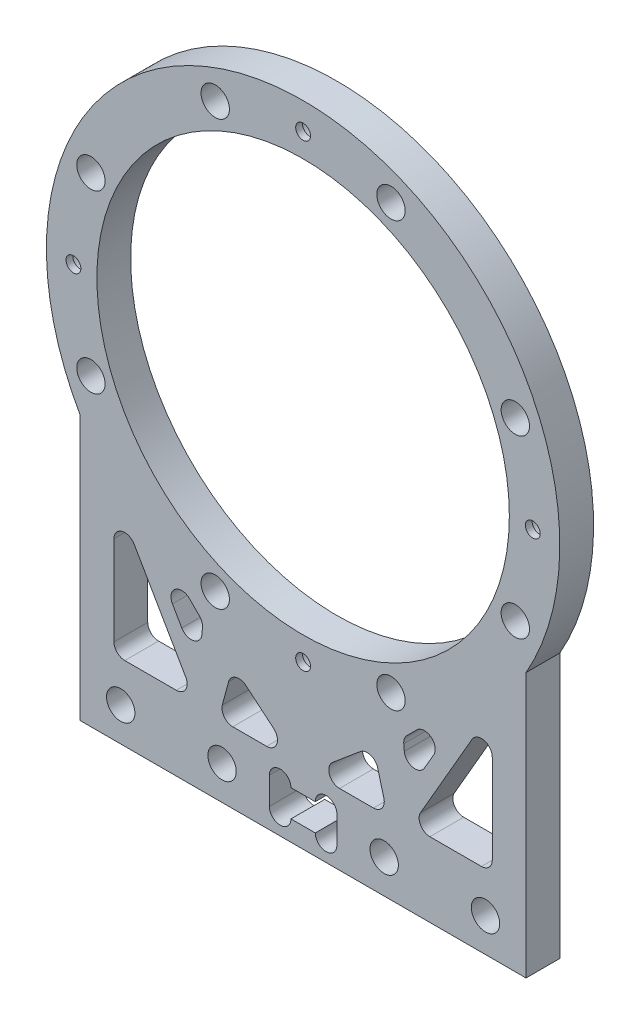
ISO-10303-21;
HEADER;
FILE_DESCRIPTION(('STEP AP214'),'2;1');
FILE_NAME('part.step','',(''),(''),'','','');
FILE_SCHEMA(('AUTOMOTIVE_DESIGN { 1 0 10303 214 1 1 1 1 }'));
ENDSEC;
DATA;
#1=APPLICATION_CONTEXT('core data for automotive mechanical design processes');
#2=APPLICATION_PROTOCOL_DEFINITION('international standard','automotive_design',2000,#1);
#3=PRODUCT_CONTEXT('',#1,'mechanical');
#4=PRODUCT('Part','Part','',(#3));
#5=PRODUCT_RELATED_PRODUCT_CATEGORY('part','',(#4));
#6=PRODUCT_DEFINITION_FORMATION('','',#4);
#7=PRODUCT_DEFINITION_CONTEXT('part definition',#1,'design');
#8=PRODUCT_DEFINITION('design','',#6,#7);
#9=PRODUCT_DEFINITION_SHAPE('','',#8);
#10=(LENGTH_UNIT() NAMED_UNIT(*) SI_UNIT(.MILLI.,.METRE.));
#11=(NAMED_UNIT(*) PLANE_ANGLE_UNIT() SI_UNIT($,.RADIAN.));
#12=(NAMED_UNIT(*) SI_UNIT($,.STERADIAN.) SOLID_ANGLE_UNIT());
#13=UNCERTAINTY_MEASURE_WITH_UNIT(LENGTH_MEASURE(1.E-05),#10,'distance_accuracy_value','');
#14=(GEOMETRIC_REPRESENTATION_CONTEXT(3) GLOBAL_UNCERTAINTY_ASSIGNED_CONTEXT((#13)) GLOBAL_UNIT_ASSIGNED_CONTEXT((#10,
#11,#12)) REPRESENTATION_CONTEXT('',''));
#15=CARTESIAN_POINT('',(0.,0.,0.));
#16=DIRECTION('',(0.,0.,1.));
#17=DIRECTION('',(1.,0.,0.));
#18=AXIS2_PLACEMENT_3D('',#15,#16,#17);
#19=CARTESIAN_POINT('',(26.4,-32.1866716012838,10.));
#20=DIRECTION('',(0.,0.,1.));
#21=DIRECTION('',(1.,0.,0.));
#22=AXIS2_PLACEMENT_3D('',#19,#20,#21);
#23=CYLINDRICAL_SURFACE('',#22,1.6);
#24=CARTESIAN_POINT('',(26.4,-32.1866716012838,5.));
#25=DIRECTION('',(0.,0.,-1.));
#26=DIRECTION('',(1.,0.,0.));
#27=AXIS2_PLACEMENT_3D('',#24,#25,#26);
#28=CIRCLE('',#27,1.6);
#29=CARTESIAN_POINT('',(25.0143593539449,-31.3866716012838,5.));
#30=VERTEX_POINT('',#29);
#31=CARTESIAN_POINT('',(28.,-32.1866716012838,5.));
#32=VERTEX_POINT('',#31);
#33=EDGE_CURVE('E586',#30,#32,#28,.T.);
#34=ORIENTED_EDGE('',*,*,#33,.F.);
#35=DIRECTION('',(0.,0.,1.));
#36=VECTOR('',#35,1.);
#37=CARTESIAN_POINT('',(25.0143593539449,-31.3866716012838,5.));
#38=LINE('',#37,#36);
#39=CARTESIAN_POINT('',(25.0143593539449,-31.3866716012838,0.));
#40=VERTEX_POINT('',#39);
#41=EDGE_CURVE('E1069',#40,#30,#38,.T.);
#42=ORIENTED_EDGE('',*,*,#41,.F.);
#43=CARTESIAN_POINT('',(26.4,-32.1866716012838,0.));
#44=DIRECTION('',(0.,0.,1.));
#45=DIRECTION('',(1.,0.,0.));
#46=AXIS2_PLACEMENT_3D('',#43,#44,#45);
#47=CIRCLE('',#46,1.6);
#48=CARTESIAN_POINT('',(28.,-32.1866716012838,0.));
#49=VERTEX_POINT('',#48);
#50=EDGE_CURVE('E990',#49,#40,#47,.T.);
#51=ORIENTED_EDGE('',*,*,#50,.F.);
#52=DIRECTION('',(0.,0.,-1.));
#53=VECTOR('',#52,1.);
#54=CARTESIAN_POINT('',(28.,-32.1866716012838,0.));
#55=LINE('',#54,#53);
#56=EDGE_CURVE('E1063',#32,#49,#55,.T.);
#57=ORIENTED_EDGE('',*,*,#56,.F.);
#58=EDGE_LOOP('',(#34,#42,#51,#57));
#59=FACE_BOUND('',#58,.T.);
#60=ADVANCED_FACE('F17',(#59),#23,.F.);
#61=CARTESIAN_POINT('',(26.4,-45.4,10.));
#62=DIRECTION('',(0.,0.,1.));
#63=DIRECTION('',(1.,0.,0.));
#64=AXIS2_PLACEMENT_3D('',#61,#62,#63);
#65=CYLINDRICAL_SURFACE('',#64,1.6);
#66=CARTESIAN_POINT('',(26.4,-45.4,5.));
#67=DIRECTION('',(0.,0.,-1.));
#68=DIRECTION('',(1.,0.,0.));
#69=AXIS2_PLACEMENT_3D('',#66,#67,#68);
#70=CIRCLE('',#69,1.6);
#71=CARTESIAN_POINT('',(28.,-45.4,5.));
#72=VERTEX_POINT('',#71);
#73=CARTESIAN_POINT('',(26.4,-47.,5.));
#74=VERTEX_POINT('',#73);
#75=EDGE_CURVE('E780',#72,#74,#70,.T.);
#76=ORIENTED_EDGE('',*,*,#75,.F.);
#77=DIRECTION('',(0.,0.,1.));
#78=VECTOR('',#77,1.);
#79=CARTESIAN_POINT('',(28.,-45.4,5.));
#80=LINE('',#79,#78);
#81=CARTESIAN_POINT('',(28.,-45.4,0.));
#82=VERTEX_POINT('',#81);
#83=EDGE_CURVE('E1060',#82,#72,#80,.T.);
#84=ORIENTED_EDGE('',*,*,#83,.F.);
#85=CARTESIAN_POINT('',(26.4,-45.4,0.));
#86=DIRECTION('',(0.,0.,1.));
#87=DIRECTION('',(1.,0.,0.));
#88=AXIS2_PLACEMENT_3D('',#85,#86,#87);
#89=CIRCLE('',#88,1.6);
#90=CARTESIAN_POINT('',(26.4,-47.,0.));
#91=VERTEX_POINT('',#90);
#92=EDGE_CURVE('E836',#91,#82,#89,.T.);
#93=ORIENTED_EDGE('',*,*,#92,.F.);
#94=DIRECTION('',(0.,0.,-1.));
#95=VECTOR('',#94,1.);
#96=CARTESIAN_POINT('',(26.4,-47.,0.));
#97=LINE('',#96,#95);
#98=EDGE_CURVE('E1057',#74,#91,#97,.T.);
#99=ORIENTED_EDGE('',*,*,#98,.F.);
#100=EDGE_LOOP('',(#76,#84,#93,#99));
#101=FACE_BOUND('',#100,.T.);
#102=ADVANCED_FACE('F1154',(#101),#65,.F.);
#103=CARTESIAN_POINT('',(18.7712812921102,-45.4,10.));
#104=DIRECTION('',(0.,0.,1.));
#105=DIRECTION('',(1.,0.,0.));
#106=AXIS2_PLACEMENT_3D('',#103,#104,#105);
#107=CYLINDRICAL_SURFACE('',#106,1.6);
#108=CARTESIAN_POINT('',(18.7712812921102,-45.4,5.));
#109=DIRECTION('',(0.,0.,-1.));
#110=DIRECTION('',(1.,0.,0.));
#111=AXIS2_PLACEMENT_3D('',#108,#109,#110);
#112=CIRCLE('',#111,1.6);
#113=CARTESIAN_POINT('',(18.7712812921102,-47.,5.));
#114=VERTEX_POINT('',#113);
#115=CARTESIAN_POINT('',(17.3856406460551,-44.6,5.));
#116=VERTEX_POINT('',#115);
#117=EDGE_CURVE('E587',#114,#116,#112,.T.);
#118=ORIENTED_EDGE('',*,*,#117,.F.);
#119=DIRECTION('',(0.,0.,1.));
#120=VECTOR('',#119,1.);
#121=CARTESIAN_POINT('',(18.7712812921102,-47.,5.));
#122=LINE('',#121,#120);
#123=CARTESIAN_POINT('',(18.7712812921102,-47.,0.));
#124=VERTEX_POINT('',#123);
#125=EDGE_CURVE('E1054',#124,#114,#122,.T.);
#126=ORIENTED_EDGE('',*,*,#125,.F.);
#127=CARTESIAN_POINT('',(18.7712812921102,-45.4,0.));
#128=DIRECTION('',(0.,0.,1.));
#129=DIRECTION('',(1.,0.,0.));
#130=AXIS2_PLACEMENT_3D('',#127,#128,#129);
#131=CIRCLE('',#130,1.6);
#132=CARTESIAN_POINT('',(17.3856406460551,-44.6,0.));
#133=VERTEX_POINT('',#132);
#134=EDGE_CURVE('E837',#133,#124,#131,.T.);
#135=ORIENTED_EDGE('',*,*,#134,.F.);
#136=DIRECTION('',(0.,0.,-1.));
#137=VECTOR('',#136,1.);
#138=CARTESIAN_POINT('',(17.3856406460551,-44.6,0.));
#139=LINE('',#138,#137);
#140=EDGE_CURVE('E1066',#116,#133,#139,.T.);
#141=ORIENTED_EDGE('',*,*,#140,.F.);
#142=EDGE_LOOP('',(#118,#126,#135,#141));
#143=FACE_BOUND('',#142,.T.);
#144=ADVANCED_FACE('F1160',(#143),#107,.F.);
#145=CARTESIAN_POINT('',(16.4926512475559,-36.8722321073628,10.));
#146=DIRECTION('',(0.,0.,1.));
#147=DIRECTION('',(1.,0.,0.));
#148=AXIS2_PLACEMENT_3D('',#145,#146,#147);
#149=CYLINDRICAL_SURFACE('',#148,1.6);
#150=CARTESIAN_POINT('',(16.4926512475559,-36.8722321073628,5.));
#151=DIRECTION('',(0.,0.,-1.));
#152=DIRECTION('',(1.,0.,0.));
#153=AXIS2_PLACEMENT_3D('',#150,#151,#152);
#154=CIRCLE('',#153,1.6);
#155=CARTESIAN_POINT('',(14.8987397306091,-37.0116812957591,5.));
#156=VERTEX_POINT('',#155);
#157=CARTESIAN_POINT('',(15.3612803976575,-35.7408612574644,5.));
#158=VERTEX_POINT('',#157);
#159=EDGE_CURVE('E727',#156,#158,#154,.T.);
#160=ORIENTED_EDGE('',*,*,#159,.F.);
#161=DIRECTION('',(0.,0.,1.));
#162=VECTOR('',#161,1.);
#163=CARTESIAN_POINT('',(14.8987397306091,-37.0116812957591,5.));
#164=LINE('',#163,#162);
#165=CARTESIAN_POINT('',(14.8987397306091,-37.0116812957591,0.));
#166=VERTEX_POINT('',#165);
#167=EDGE_CURVE('E11',#166,#156,#164,.T.);
#168=ORIENTED_EDGE('',*,*,#167,.F.);
#169=CARTESIAN_POINT('',(16.4926512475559,-36.8722321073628,0.));
#170=DIRECTION('',(0.,0.,1.));
#171=DIRECTION('',(1.,0.,0.));
#172=AXIS2_PLACEMENT_3D('',#169,#170,#171);
#173=CIRCLE('',#172,1.6);
#174=CARTESIAN_POINT('',(15.3612803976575,-35.7408612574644,0.));
#175=VERTEX_POINT('',#174);
#176=EDGE_CURVE('E435',#175,#166,#173,.T.);
#177=ORIENTED_EDGE('',*,*,#176,.F.);
#178=DIRECTION('',(0.,0.,-1.));
#179=VECTOR('',#178,1.);
#180=CARTESIAN_POINT('',(15.3612803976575,-35.7408612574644,0.));
#181=LINE('',#180,#179);
#182=EDGE_CURVE('E39',#158,#175,#181,.T.);
#183=ORIENTED_EDGE('',*,*,#182,.F.);
#184=EDGE_LOOP('',(#160,#168,#177,#183));
#185=FACE_BOUND('',#184,.T.);
#186=ADVANCED_FACE('F19',(#185),#149,.F.);
#187=CARTESIAN_POINT('',(16.5742849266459,-37.8053093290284,10.));
#188=DIRECTION('',(0.,0.,1.));
#189=DIRECTION('',(1.,0.,0.));
#190=AXIS2_PLACEMENT_3D('',#187,#188,#189);
#191=CYLINDRICAL_SURFACE('',#190,1.6);
#192=CARTESIAN_POINT('',(16.5742849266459,-37.8053093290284,5.));
#193=DIRECTION('',(0.,0.,-1.));
#194=DIRECTION('',(1.,0.,0.));
#195=AXIS2_PLACEMENT_3D('',#192,#193,#194);
#196=CIRCLE('',#195,1.6);
#197=CARTESIAN_POINT('',(17.959925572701,-38.6053093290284,5.));
#198=VERTEX_POINT('',#197);
#199=CARTESIAN_POINT('',(14.9803734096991,-37.9447585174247,5.));
#200=VERTEX_POINT('',#199);
#201=EDGE_CURVE('E880',#198,#200,#196,.T.);
#202=ORIENTED_EDGE('',*,*,#201,.F.);
#203=DIRECTION('',(0.,0.,1.));
#204=VECTOR('',#203,1.);
#205=CARTESIAN_POINT('',(17.959925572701,-38.6053093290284,5.));
#206=LINE('',#205,#204);
#207=CARTESIAN_POINT('',(17.959925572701,-38.6053093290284,0.));
#208=VERTEX_POINT('',#207);
#209=EDGE_CURVE('E1112',#208,#198,#206,.T.);
#210=ORIENTED_EDGE('',*,*,#209,.F.);
#211=CARTESIAN_POINT('',(16.5742849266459,-37.8053093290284,0.));
#212=DIRECTION('',(0.,0.,1.));
#213=DIRECTION('',(1.,0.,0.));
#214=AXIS2_PLACEMENT_3D('',#211,#212,#213);
#215=CIRCLE('',#214,1.6);
#216=CARTESIAN_POINT('',(14.9803734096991,-37.9447585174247,0.));
#217=VERTEX_POINT('',#216);
#218=EDGE_CURVE('E823',#217,#208,#215,.T.);
#219=ORIENTED_EDGE('',*,*,#218,.F.);
#220=DIRECTION('',(0.,0.,-1.));
#221=VECTOR('',#220,1.);
#222=CARTESIAN_POINT('',(14.9803734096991,-37.9447585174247,0.));
#223=LINE('',#222,#221);
#224=EDGE_CURVE('E26',#200,#217,#223,.T.);
#225=ORIENTED_EDGE('',*,*,#224,.F.);
#226=EDGE_LOOP('',(#202,#210,#219,#225));
#227=FACE_BOUND('',#226,.T.);
#228=ADVANCED_FACE('F1130',(#227),#191,.F.);
#229=CARTESIAN_POINT('',(9.49355346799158,-42.4617140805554,10.));
#230=DIRECTION('',(0.,0.,1.));
#231=DIRECTION('',(1.,0.,0.));
#232=AXIS2_PLACEMENT_3D('',#229,#230,#231);
#233=CYLINDRICAL_SURFACE('',#232,1.6);
#234=CARTESIAN_POINT('',(9.49355346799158,-42.4617140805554,5.));
#235=DIRECTION('',(0.,0.,-1.));
#236=DIRECTION('',(1.,0.,0.));
#237=AXIS2_PLACEMENT_3D('',#234,#235,#236);
#238=CIRCLE('',#237,1.6);
#239=CARTESIAN_POINT('',(8.46509329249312,-41.2360429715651,5.));
#240=VERTEX_POINT('',#239);
#241=CARTESIAN_POINT('',(11.0390347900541,-42.0476036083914,5.));
#242=VERTEX_POINT('',#241);
#243=EDGE_CURVE('E711',#240,#242,#238,.T.);
#244=ORIENTED_EDGE('',*,*,#243,.F.);
#245=DIRECTION('',(0.,0.,1.));
#246=VECTOR('',#245,1.);
#247=CARTESIAN_POINT('',(8.46509329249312,-41.2360429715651,5.));
#248=LINE('',#247,#246);
#249=CARTESIAN_POINT('',(8.46509329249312,-41.2360429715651,0.));
#250=VERTEX_POINT('',#249);
#251=EDGE_CURVE('E1109',#250,#240,#248,.T.);
#252=ORIENTED_EDGE('',*,*,#251,.F.);
#253=CARTESIAN_POINT('',(9.49355346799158,-42.4617140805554,0.));
#254=DIRECTION('',(0.,0.,1.));
#255=DIRECTION('',(1.,0.,0.));
#256=AXIS2_PLACEMENT_3D('',#253,#254,#255);
#257=CIRCLE('',#256,1.6);
#258=CARTESIAN_POINT('',(11.0390347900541,-42.0476036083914,0.));
#259=VERTEX_POINT('',#258);
#260=EDGE_CURVE('E824',#259,#250,#257,.T.);
#261=ORIENTED_EDGE('',*,*,#260,.F.);
#262=DIRECTION('',(0.,0.,-1.));
#263=VECTOR('',#262,1.);
#264=CARTESIAN_POINT('',(11.0390347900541,-42.0476036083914,0.));
#265=LINE('',#264,#263);
#266=EDGE_CURVE('E1103',#242,#259,#265,.T.);
#267=ORIENTED_EDGE('',*,*,#266,.F.);
#268=EDGE_LOOP('',(#244,#252,#261,#267));
#269=FACE_BOUND('',#268,.T.);
#270=ADVANCED_FACE('F1335',(#269),#233,.F.);
#271=CARTESIAN_POINT('',(5.39596387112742,-45.9,10.));
#272=DIRECTION('',(0.,0.,1.));
#273=DIRECTION('',(1.,0.,0.));
#274=AXIS2_PLACEMENT_3D('',#271,#272,#273);
#275=CYLINDRICAL_SURFACE('',#274,1.6);
#276=CARTESIAN_POINT('',(5.39596387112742,-45.9,5.));
#277=DIRECTION('',(0.,0.,-1.));
#278=DIRECTION('',(1.,0.,0.));
#279=AXIS2_PLACEMENT_3D('',#276,#277,#278);
#280=CIRCLE('',#279,1.6);
#281=CARTESIAN_POINT('',(5.39596387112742,-47.5,5.));
#282=VERTEX_POINT('',#281);
#283=CARTESIAN_POINT('',(4.36750369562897,-44.6743288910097,5.));
#284=VERTEX_POINT('',#283);
#285=EDGE_CURVE('E712',#282,#284,#280,.T.);
#286=ORIENTED_EDGE('',*,*,#285,.F.);
#287=DIRECTION('',(0.,0.,1.));
#288=VECTOR('',#287,1.);
#289=CARTESIAN_POINT('',(5.39596387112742,-47.5,5.));
#290=LINE('',#289,#288);
#291=CARTESIAN_POINT('',(5.39596387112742,-47.5,0.));
#292=VERTEX_POINT('',#291);
#293=EDGE_CURVE('E1096',#292,#282,#290,.T.);
#294=ORIENTED_EDGE('',*,*,#293,.F.);
#295=CARTESIAN_POINT('',(5.39596387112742,-45.9,0.));
#296=DIRECTION('',(0.,0.,1.));
#297=DIRECTION('',(1.,0.,0.));
#298=AXIS2_PLACEMENT_3D('',#295,#296,#297);
#299=CIRCLE('',#298,1.6);
#300=CARTESIAN_POINT('',(4.36750369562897,-44.6743288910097,0.));
#301=VERTEX_POINT('',#300);
#302=EDGE_CURVE('E1015',#301,#292,#299,.T.);
#303=ORIENTED_EDGE('',*,*,#302,.F.);
#304=DIRECTION('',(0.,0.,-1.));
#305=VECTOR('',#304,1.);
#306=CARTESIAN_POINT('',(4.36750369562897,-44.6743288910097,0.));
#307=LINE('',#306,#305);
#308=EDGE_CURVE('E1106',#284,#301,#307,.T.);
#309=ORIENTED_EDGE('',*,*,#308,.F.);
#310=EDGE_LOOP('',(#286,#294,#303,#309));
#311=FACE_BOUND('',#310,.T.);
#312=ADVANCED_FACE('F1260',(#311),#275,.F.);
#313=CARTESIAN_POINT('',(-9.49355346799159,-42.4617140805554,10.));
#314=DIRECTION('',(0.,0.,1.));
#315=DIRECTION('',(1.,0.,0.));
#316=AXIS2_PLACEMENT_3D('',#313,#314,#315);
#317=CYLINDRICAL_SURFACE('',#316,1.6);
#318=CARTESIAN_POINT('',(-9.49355346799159,-42.4617140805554,5.));
#319=DIRECTION('',(0.,0.,-1.));
#320=DIRECTION('',(1.,0.,0.));
#321=AXIS2_PLACEMENT_3D('',#318,#319,#320);
#322=CIRCLE('',#321,1.6);
#323=CARTESIAN_POINT('',(-11.0390347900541,-42.0476036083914,5.));
#324=VERTEX_POINT('',#323);
#325=CARTESIAN_POINT('',(-8.46509329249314,-41.2360429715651,5.));
#326=VERTEX_POINT('',#325);
#327=EDGE_CURVE('E863',#324,#326,#322,.T.);
#328=ORIENTED_EDGE('',*,*,#327,.F.);
#329=DIRECTION('',(0.,0.,1.));
#330=VECTOR('',#329,1.);
#331=CARTESIAN_POINT('',(-11.0390347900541,-42.0476036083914,5.));
#332=LINE('',#331,#330);
#333=CARTESIAN_POINT('',(-11.0390347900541,-42.0476036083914,0.));
#334=VERTEX_POINT('',#333);
#335=EDGE_CURVE('E466',#334,#324,#332,.T.);
#336=ORIENTED_EDGE('',*,*,#335,.F.);
#337=CARTESIAN_POINT('',(-9.49355346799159,-42.4617140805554,0.));
#338=DIRECTION('',(0.,0.,1.));
#339=DIRECTION('',(1.,0.,0.));
#340=AXIS2_PLACEMENT_3D('',#337,#338,#339);
#341=CIRCLE('',#340,1.6);
#342=CARTESIAN_POINT('',(-8.46509329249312,-41.2360429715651,0.));
#343=VERTEX_POINT('',#342);
#344=EDGE_CURVE('E910',#343,#334,#341,.T.);
#345=ORIENTED_EDGE('',*,*,#344,.F.);
#346=DIRECTION('',(0.,0.,-1.));
#347=VECTOR('',#346,1.);
#348=CARTESIAN_POINT('',(-8.46509329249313,-41.2360429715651,0.));
#349=LINE('',#348,#347);
#350=EDGE_CURVE('E467',#326,#343,#349,.T.);
#351=ORIENTED_EDGE('',*,*,#350,.F.);
#352=EDGE_LOOP('',(#328,#336,#345,#351));
#353=FACE_BOUND('',#352,.T.);
#354=ADVANCED_FACE('F1256',(#353),#317,.F.);
#355=CARTESIAN_POINT('',(-10.4148394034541,-45.9,10.));
#356=DIRECTION('',(0.,0.,1.));
#357=DIRECTION('',(1.,0.,0.));
#358=AXIS2_PLACEMENT_3D('',#355,#356,#357);
#359=CYLINDRICAL_SURFACE('',#358,1.6);
#360=CARTESIAN_POINT('',(-10.4148394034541,-45.9,5.));
#361=DIRECTION('',(0.,0.,-1.));
#362=DIRECTION('',(1.,0.,0.));
#363=AXIS2_PLACEMENT_3D('',#360,#361,#362);
#364=CIRCLE('',#363,1.6);
#365=CARTESIAN_POINT('',(-10.4148394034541,-47.5,5.));
#366=VERTEX_POINT('',#365);
#367=CARTESIAN_POINT('',(-11.9603207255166,-45.485889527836,5.));
#368=VERTEX_POINT('',#367);
#369=EDGE_CURVE('E855',#366,#368,#364,.T.);
#370=ORIENTED_EDGE('',*,*,#369,.F.);
#371=DIRECTION('',(0.,0.,1.));
#372=VECTOR('',#371,1.);
#373=CARTESIAN_POINT('',(-10.4148394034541,-47.5,5.));
#374=LINE('',#373,#372);
#375=CARTESIAN_POINT('',(-10.4148394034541,-47.5,0.));
#376=VERTEX_POINT('',#375);
#377=EDGE_CURVE('E1093',#376,#366,#374,.T.);
#378=ORIENTED_EDGE('',*,*,#377,.F.);
#379=CARTESIAN_POINT('',(-10.4148394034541,-45.9,0.));
#380=DIRECTION('',(0.,0.,1.));
#381=DIRECTION('',(1.,0.,0.));
#382=AXIS2_PLACEMENT_3D('',#379,#380,#381);
#383=CIRCLE('',#382,1.6);
#384=CARTESIAN_POINT('',(-11.9603207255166,-45.485889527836,0.));
#385=VERTEX_POINT('',#384);
#386=EDGE_CURVE('E918',#385,#376,#383,.T.);
#387=ORIENTED_EDGE('',*,*,#386,.F.);
#388=DIRECTION('',(0.,0.,-1.));
#389=VECTOR('',#388,1.);
#390=CARTESIAN_POINT('',(-11.9603207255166,-45.485889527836,0.));
#391=LINE('',#390,#389);
#392=EDGE_CURVE('E464',#368,#385,#391,.T.);
#393=ORIENTED_EDGE('',*,*,#392,.F.);
#394=EDGE_LOOP('',(#370,#378,#387,#393));
#395=FACE_BOUND('',#394,.T.);
#396=ADVANCED_FACE('F1259',(#395),#359,.F.);
#397=CARTESIAN_POINT('',(-16.5742849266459,-37.8053093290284,10.));
#398=DIRECTION('',(0.,0.,1.));
#399=DIRECTION('',(1.,0.,0.));
#400=AXIS2_PLACEMENT_3D('',#397,#398,#399);
#401=CYLINDRICAL_SURFACE('',#400,1.6);
#402=CARTESIAN_POINT('',(-16.5742849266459,-37.8053093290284,5.));
#403=DIRECTION('',(0.,0.,-1.));
#404=DIRECTION('',(1.,0.,0.));
#405=AXIS2_PLACEMENT_3D('',#402,#403,#404);
#406=CIRCLE('',#405,1.6);
#407=CARTESIAN_POINT('',(-14.9803734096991,-37.9447585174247,5.));
#408=VERTEX_POINT('',#407);
#409=CARTESIAN_POINT('',(-17.959925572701,-38.6053093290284,5.));
#410=VERTEX_POINT('',#409);
#411=EDGE_CURVE('E635',#408,#410,#406,.T.);
#412=ORIENTED_EDGE('',*,*,#411,.F.);
#413=DIRECTION('',(0.,0.,1.));
#414=VECTOR('',#413,1.);
#415=CARTESIAN_POINT('',(-14.9803734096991,-37.9447585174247,5.));
#416=LINE('',#415,#414);
#417=CARTESIAN_POINT('',(-14.9803734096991,-37.9447585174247,0.));
#418=VERTEX_POINT('',#417);
#419=EDGE_CURVE('E893',#418,#408,#416,.T.);
#420=ORIENTED_EDGE('',*,*,#419,.F.);
#421=CARTESIAN_POINT('',(-16.5742849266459,-37.8053093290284,0.));
#422=DIRECTION('',(0.,0.,1.));
#423=DIRECTION('',(1.,0.,0.));
#424=AXIS2_PLACEMENT_3D('',#421,#422,#423);
#425=CIRCLE('',#424,1.6);
#426=CARTESIAN_POINT('',(-17.959925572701,-38.6053093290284,0.));
#427=VERTEX_POINT('',#426);
#428=EDGE_CURVE('E933',#427,#418,#425,.T.);
#429=ORIENTED_EDGE('',*,*,#428,.F.);
#430=DIRECTION('',(0.,0.,-1.));
#431=VECTOR('',#430,1.);
#432=CARTESIAN_POINT('',(-17.959925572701,-38.6053093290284,0.));
#433=LINE('',#432,#431);
#434=EDGE_CURVE('E894',#410,#427,#433,.T.);
#435=ORIENTED_EDGE('',*,*,#434,.F.);
#436=EDGE_LOOP('',(#412,#420,#429,#435));
#437=FACE_BOUND('',#436,.T.);
#438=ADVANCED_FACE('F1327',(#437),#401,.F.);
#439=CARTESIAN_POINT('',(-17.960405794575,-35.4044775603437,10.));
#440=DIRECTION('',(0.,0.,1.));
#441=DIRECTION('',(1.,0.,0.));
#442=AXIS2_PLACEMENT_3D('',#439,#440,#441);
#443=CYLINDRICAL_SURFACE('',#442,1.6);
#444=CARTESIAN_POINT('',(-17.960405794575,-35.4044775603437,5.));
#445=DIRECTION('',(0.,0.,-1.));
#446=DIRECTION('',(1.,0.,0.));
#447=AXIS2_PLACEMENT_3D('',#444,#445,#446);
#448=CIRCLE('',#447,1.6);
#449=CARTESIAN_POINT('',(-19.3460464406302,-36.2044775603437,5.));
#450=VERTEX_POINT('',#449);
#451=CARTESIAN_POINT('',(-16.8290349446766,-34.2731067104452,5.));
#452=VERTEX_POINT('',#451);
#453=EDGE_CURVE('E462',#450,#452,#448,.T.);
#454=ORIENTED_EDGE('',*,*,#453,.F.);
#455=DIRECTION('',(0.,0.,1.));
#456=VECTOR('',#455,1.);
#457=CARTESIAN_POINT('',(-19.3460464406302,-36.2044775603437,5.));
#458=LINE('',#457,#456);
#459=CARTESIAN_POINT('',(-19.3460464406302,-36.2044775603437,0.));
#460=VERTEX_POINT('',#459);
#461=EDGE_CURVE('E973',#460,#450,#458,.T.);
#462=ORIENTED_EDGE('',*,*,#461,.F.);
#463=CARTESIAN_POINT('',(-17.960405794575,-35.4044775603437,0.));
#464=DIRECTION('',(0.,0.,1.));
#465=DIRECTION('',(1.,0.,0.));
#466=AXIS2_PLACEMENT_3D('',#463,#464,#465);
#467=CIRCLE('',#466,1.6);
#468=CARTESIAN_POINT('',(-16.8290349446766,-34.2731067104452,0.));
#469=VERTEX_POINT('',#468);
#470=EDGE_CURVE('E925',#469,#460,#467,.T.);
#471=ORIENTED_EDGE('',*,*,#470,.F.);
#472=DIRECTION('',(0.,0.,-1.));
#473=VECTOR('',#472,1.);
#474=CARTESIAN_POINT('',(-16.8290349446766,-34.2731067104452,0.));
#475=LINE('',#474,#473);
#476=EDGE_CURVE('E1035',#452,#469,#475,.T.);
#477=ORIENTED_EDGE('',*,*,#476,.F.);
#478=EDGE_LOOP('',(#454,#462,#471,#477));
#479=FACE_BOUND('',#478,.T.);
#480=ADVANCED_FACE('F1201',(#479),#443,.F.);
#481=CARTESIAN_POINT('',(-26.4,-45.4,10.));
#482=DIRECTION('',(0.,0.,1.));
#483=DIRECTION('',(1.,0.,0.));
#484=AXIS2_PLACEMENT_3D('',#481,#482,#483);
#485=CYLINDRICAL_SURFACE('',#484,1.6);
#486=CARTESIAN_POINT('',(-26.4,-45.4,5.));
#487=DIRECTION('',(0.,0.,-1.));
#488=DIRECTION('',(1.,0.,0.));
#489=AXIS2_PLACEMENT_3D('',#486,#487,#488);
#490=CIRCLE('',#489,1.6);
#491=CARTESIAN_POINT('',(-26.4,-47.,5.));
#492=VERTEX_POINT('',#491);
#493=CARTESIAN_POINT('',(-28.,-45.4,5.));
#494=VERTEX_POINT('',#493);
#495=EDGE_CURVE('E831',#492,#494,#490,.T.);
#496=ORIENTED_EDGE('',*,*,#495,.F.);
#497=DIRECTION('',(0.,0.,1.));
#498=VECTOR('',#497,1.);
#499=CARTESIAN_POINT('',(-26.4,-47.,5.));
#500=LINE('',#499,#498);
#501=CARTESIAN_POINT('',(-26.4,-47.,0.));
#502=VERTEX_POINT('',#501);
#503=EDGE_CURVE('E997',#502,#492,#500,.T.);
#504=ORIENTED_EDGE('',*,*,#503,.F.);
#505=CARTESIAN_POINT('',(-26.4,-45.4,0.));
#506=DIRECTION('',(0.,0.,1.));
#507=DIRECTION('',(1.,0.,0.));
#508=AXIS2_PLACEMENT_3D('',#505,#506,#507);
#509=CIRCLE('',#508,1.6);
#510=CARTESIAN_POINT('',(-28.,-45.4,0.));
#511=VERTEX_POINT('',#510);
#512=EDGE_CURVE('E951',#511,#502,#509,.T.);
#513=ORIENTED_EDGE('',*,*,#512,.F.);
#514=DIRECTION('',(0.,0.,-1.));
#515=VECTOR('',#514,1.);
#516=CARTESIAN_POINT('',(-28.,-45.4,0.));
#517=LINE('',#516,#515);
#518=EDGE_CURVE('E1075',#494,#511,#517,.T.);
#519=ORIENTED_EDGE('',*,*,#518,.F.);
#520=EDGE_LOOP('',(#496,#504,#513,#519));
#521=FACE_BOUND('',#520,.T.);
#522=ADVANCED_FACE('F1197',(#521),#485,.F.);
#523=CARTESIAN_POINT('',(-26.4,-32.1866716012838,10.));
#524=DIRECTION('',(0.,0.,1.));
#525=DIRECTION('',(1.,0.,0.));
#526=AXIS2_PLACEMENT_3D('',#523,#524,#525);
#527=CYLINDRICAL_SURFACE('',#526,1.6);
#528=CARTESIAN_POINT('',(-26.4,-32.1866716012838,5.));
#529=DIRECTION('',(0.,0.,-1.));
#530=DIRECTION('',(1.,0.,0.));
#531=AXIS2_PLACEMENT_3D('',#528,#529,#530);
#532=CIRCLE('',#531,1.6);
#533=CARTESIAN_POINT('',(-28.,-32.1866716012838,5.));
#534=VERTEX_POINT('',#533);
#535=CARTESIAN_POINT('',(-25.0143593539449,-31.3866716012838,5.));
#536=VERTEX_POINT('',#535);
#537=EDGE_CURVE('E847',#534,#536,#532,.T.);
#538=ORIENTED_EDGE('',*,*,#537,.F.);
#539=DIRECTION('',(0.,0.,1.));
#540=VECTOR('',#539,1.);
#541=CARTESIAN_POINT('',(-28.,-32.1866716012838,5.));
#542=LINE('',#541,#540);
#543=CARTESIAN_POINT('',(-28.,-32.1866716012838,0.));
#544=VERTEX_POINT('',#543);
#545=EDGE_CURVE('E1072',#544,#534,#542,.T.);
#546=ORIENTED_EDGE('',*,*,#545,.F.);
#547=CARTESIAN_POINT('',(-26.4,-32.1866716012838,0.));
#548=DIRECTION('',(0.,0.,1.));
#549=DIRECTION('',(1.,0.,0.));
#550=AXIS2_PLACEMENT_3D('',#547,#548,#549);
#551=CIRCLE('',#550,1.6);
#552=CARTESIAN_POINT('',(-25.0143593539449,-31.3866716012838,0.));
#553=VERTEX_POINT('',#552);
#554=EDGE_CURVE('E1001',#553,#544,#551,.T.);
#555=ORIENTED_EDGE('',*,*,#554,.F.);
#556=DIRECTION('',(0.,0.,-1.));
#557=VECTOR('',#556,1.);
#558=CARTESIAN_POINT('',(-25.0143593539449,-31.3866716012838,0.));
#559=LINE('',#558,#557);
#560=EDGE_CURVE('E976',#536,#553,#559,.T.);
#561=ORIENTED_EDGE('',*,*,#560,.F.);
#562=EDGE_LOOP('',(#538,#546,#555,#561));
#563=FACE_BOUND('',#562,.T.);
#564=ADVANCED_FACE('F1200',(#563),#527,.F.);
#565=CARTESIAN_POINT('',(11.5720615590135,1.01242420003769,10.));
#566=DIRECTION('',(0.996194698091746,0.0871557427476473,0.));
#567=DIRECTION('',(0.,0.,-1.));
#568=AXIS2_PLACEMENT_3D('',#565,#566,#567);
#569=PLANE('',#568);
#570=DIRECTION('',(-0.0871557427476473,0.996194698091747,0.));
#571=VECTOR('',#570,1.);
#572=CARTESIAN_POINT('',(11.5720615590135,1.01242420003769,5.));
#573=LINE('',#572,#571);
#574=EDGE_CURVE('E870',#200,#156,#573,.T.);
#575=ORIENTED_EDGE('',*,*,#574,.F.);
#576=ORIENTED_EDGE('',*,*,#224,.T.);
#577=DIRECTION('',(0.0871557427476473,-0.996194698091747,0.));
#578=VECTOR('',#577,1.);
#579=CARTESIAN_POINT('',(11.5720615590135,1.01242420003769,0.));
#580=LINE('',#579,#578);
#581=EDGE_CURVE('E820',#166,#217,#580,.T.);
#582=ORIENTED_EDGE('',*,*,#581,.F.);
#583=ORIENTED_EDGE('',*,*,#167,.T.);
#584=EDGE_LOOP('',(#575,#576,#582,#583));
#585=FACE_BOUND('',#584,.T.);
#586=ADVANCED_FACE('F1127',(#585),#569,.T.);
#587=CARTESIAN_POINT('',(25.5510708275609,-25.5510708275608,10.));
#588=DIRECTION('',(0.707106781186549,-0.707106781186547,0.));
#589=DIRECTION('',(0.,0.,-1.));
#590=AXIS2_PLACEMENT_3D('',#587,#588,#589);
#591=PLANE('',#590);
#592=DIRECTION('',(0.707106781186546,0.707106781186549,0.));
#593=VECTOR('',#592,1.);
#594=CARTESIAN_POINT('',(25.5510708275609,-25.5510708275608,5.));
#595=LINE('',#594,#593);
#596=CARTESIAN_POINT('',(16.8290349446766,-34.2731067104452,5.));
#597=VERTEX_POINT('',#596);
#598=EDGE_CURVE('E723',#158,#597,#595,.T.);
#599=ORIENTED_EDGE('',*,*,#598,.F.);
#600=ORIENTED_EDGE('',*,*,#182,.T.);
#601=DIRECTION('',(-0.707106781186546,-0.707106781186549,0.));
#602=VECTOR('',#601,1.);
#603=CARTESIAN_POINT('',(25.5510708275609,-25.5510708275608,0.));
#604=LINE('',#603,#602);
#605=CARTESIAN_POINT('',(16.8290349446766,-34.2731067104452,0.));
#606=VERTEX_POINT('',#605);
#607=EDGE_CURVE('E428',#606,#175,#604,.T.);
#608=ORIENTED_EDGE('',*,*,#607,.F.);
#609=DIRECTION('',(0.,0.,1.));
#610=VECTOR('',#609,1.);
#611=CARTESIAN_POINT('',(16.8290349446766,-34.2731067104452,5.));
#612=LINE('',#611,#610);
#613=EDGE_CURVE('E430',#606,#597,#612,.T.);
#614=ORIENTED_EDGE('',*,*,#613,.T.);
#615=EDGE_LOOP('',(#599,#600,#608,#614));
#616=FACE_BOUND('',#615,.T.);
#617=ADVANCED_FACE('F429',(#616),#591,.T.);
#618=CARTESIAN_POINT('',(30.1865334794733,-17.4282032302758,10.));
#619=DIRECTION('',(-0.866025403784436,0.5,0.));
#620=DIRECTION('',(0.,0.,1.));
#621=AXIS2_PLACEMENT_3D('',#618,#619,#620);
#622=PLANE('',#621);
#623=DIRECTION('',(0.5,0.866025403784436,0.));
#624=VECTOR('',#623,1.);
#625=CARTESIAN_POINT('',(30.1865334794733,-17.4282032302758,0.));
#626=LINE('',#625,#624);
#627=CARTESIAN_POINT('',(19.3460464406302,-36.2044775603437,0.));
#628=VERTEX_POINT('',#627);
#629=EDGE_CURVE('E436',#208,#628,#626,.T.);
#630=ORIENTED_EDGE('',*,*,#629,.F.);
#631=ORIENTED_EDGE('',*,*,#209,.T.);
#632=DIRECTION('',(-0.5,-0.866025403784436,0.));
#633=VECTOR('',#632,1.);
#634=CARTESIAN_POINT('',(30.1865334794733,-17.4282032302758,5.));
#635=LINE('',#634,#633);
#636=CARTESIAN_POINT('',(19.3460464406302,-36.2044775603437,5.));
#637=VERTEX_POINT('',#636);
#638=EDGE_CURVE('E726',#637,#198,#635,.T.);
#639=ORIENTED_EDGE('',*,*,#638,.F.);
#640=DIRECTION('',(0.,0.,-1.));
#641=VECTOR('',#640,1.);
#642=CARTESIAN_POINT('',(19.3460464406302,-36.2044775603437,0.));
#643=LINE('',#642,#641);
#644=EDGE_CURVE('E1115',#637,#628,#643,.T.);
#645=ORIENTED_EDGE('',*,*,#644,.T.);
#646=EDGE_LOOP('',(#630,#631,#639,#645));
#647=FACE_BOUND('',#646,.T.);
#648=ADVANCED_FACE('F1138',(#647),#622,.T.);
#649=CARTESIAN_POINT('',(23.8023600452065,-28.366548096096,10.));
#650=DIRECTION('',(-0.642787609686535,0.766044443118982,0.));
#651=DIRECTION('',(0.,0.,1.));
#652=AXIS2_PLACEMENT_3D('',#649,#650,#651);
#653=PLANE('',#652);
#654=DIRECTION('',(-0.766044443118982,-0.642787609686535,0.));
#655=VECTOR('',#654,1.);
#656=CARTESIAN_POINT('',(23.8023600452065,-28.366548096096,5.));
#657=LINE('',#656,#655);
#658=EDGE_CURVE('E707',#240,#284,#657,.T.);
#659=ORIENTED_EDGE('',*,*,#658,.T.);
#660=ORIENTED_EDGE('',*,*,#308,.T.);
#661=DIRECTION('',(0.766044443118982,0.642787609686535,0.));
#662=VECTOR('',#661,1.);
#663=CARTESIAN_POINT('',(23.8023600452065,-28.366548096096,0.));
#664=LINE('',#663,#662);
#665=EDGE_CURVE('E950',#301,#250,#664,.T.);
#666=ORIENTED_EDGE('',*,*,#665,.T.);
#667=ORIENTED_EDGE('',*,*,#251,.T.);
#668=EDGE_LOOP('',(#659,#660,#666,#667));
#669=FACE_BOUND('',#668,.T.);
#670=ADVANCED_FACE('F1140',(#669),#653,.F.);
#671=CARTESIAN_POINT('',(-0.212341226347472,-0.0568966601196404,10.));
#672=DIRECTION('',(0.965925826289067,0.258819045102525,0.));
#673=DIRECTION('',(0.,0.,-1.));
#674=AXIS2_PLACEMENT_3D('',#671,#672,#673);
#675=PLANE('',#674);
#676=DIRECTION('',(-0.258819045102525,0.965925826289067,0.));
#677=VECTOR('',#676,1.);
#678=CARTESIAN_POINT('',(-0.212341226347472,-0.0568966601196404,5.));
#679=LINE('',#678,#677);
#680=CARTESIAN_POINT('',(11.9603207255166,-45.485889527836,5.));
#681=VERTEX_POINT('',#680);
#682=EDGE_CURVE('E463',#681,#242,#679,.T.);
#683=ORIENTED_EDGE('',*,*,#682,.T.);
#684=ORIENTED_EDGE('',*,*,#266,.T.);
#685=DIRECTION('',(0.258819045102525,-0.965925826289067,0.));
#686=VECTOR('',#685,1.);
#687=CARTESIAN_POINT('',(-0.212341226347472,-0.0568966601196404,0.));
#688=LINE('',#687,#686);
#689=CARTESIAN_POINT('',(11.9603207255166,-45.485889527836,0.));
#690=VERTEX_POINT('',#689);
#691=EDGE_CURVE('E1023',#259,#690,#688,.T.);
#692=ORIENTED_EDGE('',*,*,#691,.T.);
#693=DIRECTION('',(0.,0.,1.));
#694=VECTOR('',#693,1.);
#695=CARTESIAN_POINT('',(11.9603207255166,-45.485889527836,5.));
#696=LINE('',#695,#694);
#697=EDGE_CURVE('E486',#690,#681,#696,.T.);
#698=ORIENTED_EDGE('',*,*,#697,.T.);
#699=EDGE_LOOP('',(#683,#684,#692,#698));
#700=FACE_BOUND('',#699,.T.);
#701=ADVANCED_FACE('F1147',(#700),#675,.F.);
#702=CARTESIAN_POINT('',(0.,-47.5,10.));
#703=DIRECTION('',(0.,-1.,0.));
#704=DIRECTION('',(-1.,0.,0.));
#705=AXIS2_PLACEMENT_3D('',#702,#703,#704);
#706=PLANE('',#705);
#707=DIRECTION('',(-1.,0.,0.));
#708=VECTOR('',#707,1.);
#709=CARTESIAN_POINT('',(0.,-47.5,0.));
#710=LINE('',#709,#708);
#711=CARTESIAN_POINT('',(10.4148394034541,-47.5,0.));
#712=VERTEX_POINT('',#711);
#713=EDGE_CURVE('E1019',#712,#292,#710,.T.);
#714=ORIENTED_EDGE('',*,*,#713,.T.);
#715=ORIENTED_EDGE('',*,*,#293,.T.);
#716=DIRECTION('',(1.,0.,0.));
#717=VECTOR('',#716,1.);
#718=CARTESIAN_POINT('',(0.,-47.5,5.));
#719=LINE('',#718,#717);
#720=CARTESIAN_POINT('',(10.4148394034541,-47.5,5.));
#721=VERTEX_POINT('',#720);
#722=EDGE_CURVE('E737',#282,#721,#719,.T.);
#723=ORIENTED_EDGE('',*,*,#722,.T.);
#724=DIRECTION('',(0.,0.,-1.));
#725=VECTOR('',#724,1.);
#726=CARTESIAN_POINT('',(10.4148394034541,-47.5,0.));
#727=LINE('',#726,#725);
#728=EDGE_CURVE('E1099',#721,#712,#727,.T.);
#729=ORIENTED_EDGE('',*,*,#728,.T.);
#730=EDGE_LOOP('',(#714,#715,#723,#729));
#731=FACE_BOUND('',#730,.T.);
#732=ADVANCED_FACE('F1220',(#731),#706,.F.);
#733=CARTESIAN_POINT('',(0.,-47.5,10.));
#734=DIRECTION('',(0.,1.,0.));
#735=DIRECTION('',(1.,0.,0.));
#736=AXIS2_PLACEMENT_3D('',#733,#734,#735);
#737=PLANE('',#736);
#738=DIRECTION('',(-1.,0.,0.));
#739=VECTOR('',#738,1.);
#740=CARTESIAN_POINT('',(0.,-47.5,5.));
#741=LINE('',#740,#739);
#742=CARTESIAN_POINT('',(-5.39596387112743,-47.5,5.));
#743=VERTEX_POINT('',#742);
#744=EDGE_CURVE('E851',#743,#366,#741,.T.);
#745=ORIENTED_EDGE('',*,*,#744,.F.);
#746=DIRECTION('',(0.,0.,-1.));
#747=VECTOR('',#746,1.);
#748=CARTESIAN_POINT('',(-5.39596387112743,-47.5,0.));
#749=LINE('',#748,#747);
#750=CARTESIAN_POINT('',(-5.39596387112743,-47.5,0.));
#751=VERTEX_POINT('',#750);
#752=EDGE_CURVE('E746',#743,#751,#749,.T.);
#753=ORIENTED_EDGE('',*,*,#752,.T.);
#754=DIRECTION('',(1.,0.,0.));
#755=VECTOR('',#754,1.);
#756=CARTESIAN_POINT('',(0.,-47.5,0.));
#757=LINE('',#756,#755);
#758=EDGE_CURVE('E902',#376,#751,#757,.T.);
#759=ORIENTED_EDGE('',*,*,#758,.F.);
#760=ORIENTED_EDGE('',*,*,#377,.T.);
#761=EDGE_LOOP('',(#745,#753,#759,#760));
#762=FACE_BOUND('',#761,.T.);
#763=ADVANCED_FACE('F1216',(#762),#737,.T.);
#764=CARTESIAN_POINT('',(0.212341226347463,-0.0568966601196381,10.));
#765=DIRECTION('',(0.965925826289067,-0.258819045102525,0.));
#766=DIRECTION('',(0.,0.,-1.));
#767=AXIS2_PLACEMENT_3D('',#764,#765,#766);
#768=PLANE('',#767);
#769=DIRECTION('',(0.258819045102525,0.965925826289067,0.));
#770=VECTOR('',#769,1.);
#771=CARTESIAN_POINT('',(0.212341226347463,-0.0568966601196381,5.));
#772=LINE('',#771,#770);
#773=EDGE_CURVE('E859',#368,#324,#772,.T.);
#774=ORIENTED_EDGE('',*,*,#773,.F.);
#775=ORIENTED_EDGE('',*,*,#392,.T.);
#776=DIRECTION('',(-0.258819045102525,-0.965925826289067,0.));
#777=VECTOR('',#776,1.);
#778=CARTESIAN_POINT('',(0.212341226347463,-0.0568966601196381,0.));
#779=LINE('',#778,#777);
#780=EDGE_CURVE('E914',#334,#385,#779,.T.);
#781=ORIENTED_EDGE('',*,*,#780,.F.);
#782=ORIENTED_EDGE('',*,*,#335,.T.);
#783=EDGE_LOOP('',(#774,#775,#781,#782));
#784=FACE_BOUND('',#783,.T.);
#785=ADVANCED_FACE('F1219',(#784),#768,.T.);
#786=CARTESIAN_POINT('',(-23.8023600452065,-28.366548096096,10.));
#787=DIRECTION('',(-0.642787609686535,-0.766044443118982,0.));
#788=DIRECTION('',(-0.766044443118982,0.642787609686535,0.));
#789=AXIS2_PLACEMENT_3D('',#786,#787,#788);
#790=PLANE('',#789);
#791=DIRECTION('',(-0.766044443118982,0.642787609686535,0.));
#792=VECTOR('',#791,1.);
#793=CARTESIAN_POINT('',(-23.8023600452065,-28.366548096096,0.));
#794=LINE('',#793,#792);
#795=CARTESIAN_POINT('',(-4.36750369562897,-44.6743288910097,0.));
#796=VERTEX_POINT('',#795);
#797=EDGE_CURVE('E906',#796,#343,#794,.T.);
#798=ORIENTED_EDGE('',*,*,#797,.F.);
#799=DIRECTION('',(0.,0.,1.));
#800=VECTOR('',#799,1.);
#801=CARTESIAN_POINT('',(-4.36750369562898,-44.6743288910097,5.));
#802=LINE('',#801,#800);
#803=CARTESIAN_POINT('',(-4.36750369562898,-44.6743288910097,5.));
#804=VERTEX_POINT('',#803);
#805=EDGE_CURVE('E483',#796,#804,#802,.T.);
#806=ORIENTED_EDGE('',*,*,#805,.T.);
#807=DIRECTION('',(0.766044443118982,-0.642787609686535,0.));
#808=VECTOR('',#807,1.);
#809=CARTESIAN_POINT('',(-23.8023600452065,-28.366548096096,5.));
#810=LINE('',#809,#808);
#811=EDGE_CURVE('E867',#326,#804,#810,.T.);
#812=ORIENTED_EDGE('',*,*,#811,.F.);
#813=ORIENTED_EDGE('',*,*,#350,.T.);
#814=EDGE_LOOP('',(#798,#806,#812,#813));
#815=FACE_BOUND('',#814,.T.);
#816=ADVANCED_FACE('F1276',(#815),#790,.T.);
#817=CARTESIAN_POINT('',(-25.5510708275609,-25.5510708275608,10.));
#818=DIRECTION('',(0.707106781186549,0.707106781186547,0.));
#819=DIRECTION('',(0.,0.,-1.));
#820=AXIS2_PLACEMENT_3D('',#817,#818,#819);
#821=PLANE('',#820);
#822=DIRECTION('',(-0.707106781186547,0.707106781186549,0.));
#823=VECTOR('',#822,1.);
#824=CARTESIAN_POINT('',(-25.5510708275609,-25.5510708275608,5.));
#825=LINE('',#824,#823);
#826=CARTESIAN_POINT('',(-15.3612803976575,-35.7408612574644,5.));
#827=VERTEX_POINT('',#826);
#828=EDGE_CURVE('E613',#827,#452,#825,.T.);
#829=ORIENTED_EDGE('',*,*,#828,.T.);
#830=ORIENTED_EDGE('',*,*,#476,.T.);
#831=DIRECTION('',(0.707106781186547,-0.707106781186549,0.));
#832=VECTOR('',#831,1.);
#833=CARTESIAN_POINT('',(-25.5510708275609,-25.5510708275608,0.));
#834=LINE('',#833,#832);
#835=CARTESIAN_POINT('',(-15.3612803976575,-35.7408612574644,0.));
#836=VERTEX_POINT('',#835);
#837=EDGE_CURVE('E922',#469,#836,#834,.T.);
#838=ORIENTED_EDGE('',*,*,#837,.T.);
#839=DIRECTION('',(0.,0.,1.));
#840=VECTOR('',#839,1.);
#841=CARTESIAN_POINT('',(-15.3612803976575,-35.7408612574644,5.));
#842=LINE('',#841,#840);
#843=EDGE_CURVE('E492',#836,#827,#842,.T.);
#844=ORIENTED_EDGE('',*,*,#843,.T.);
#845=EDGE_LOOP('',(#829,#830,#838,#844));
#846=FACE_BOUND('',#845,.T.);
#847=ADVANCED_FACE('F1279',(#846),#821,.F.);
#848=CARTESIAN_POINT('',(-11.5720615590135,1.01242420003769,10.));
#849=DIRECTION('',(0.996194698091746,-0.0871557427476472,0.));
#850=DIRECTION('',(0.,0.,-1.));
#851=AXIS2_PLACEMENT_3D('',#848,#849,#850);
#852=PLANE('',#851);
#853=DIRECTION('',(0.0871557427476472,0.996194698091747,0.));
#854=VECTOR('',#853,1.);
#855=CARTESIAN_POINT('',(-11.5720615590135,1.01242420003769,5.));
#856=LINE('',#855,#854);
#857=CARTESIAN_POINT('',(-14.8987397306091,-37.0116812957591,5.));
#858=VERTEX_POINT('',#857);
#859=EDGE_CURVE('E617',#408,#858,#856,.T.);
#860=ORIENTED_EDGE('',*,*,#859,.T.);
#861=DIRECTION('',(0.,0.,-1.));
#862=VECTOR('',#861,1.);
#863=CARTESIAN_POINT('',(-14.8987397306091,-37.0116812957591,0.));
#864=LINE('',#863,#862);
#865=CARTESIAN_POINT('',(-14.8987397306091,-37.0116812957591,0.));
#866=VERTEX_POINT('',#865);
#867=EDGE_CURVE('E889',#858,#866,#864,.T.);
#868=ORIENTED_EDGE('',*,*,#867,.T.);
#869=DIRECTION('',(-0.0871557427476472,-0.996194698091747,0.));
#870=VECTOR('',#869,1.);
#871=CARTESIAN_POINT('',(-11.5720615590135,1.01242420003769,0.));
#872=LINE('',#871,#870);
#873=EDGE_CURVE('E937',#866,#418,#872,.T.);
#874=ORIENTED_EDGE('',*,*,#873,.T.);
#875=ORIENTED_EDGE('',*,*,#419,.T.);
#876=EDGE_LOOP('',(#860,#868,#874,#875));
#877=FACE_BOUND('',#876,.T.);
#878=ADVANCED_FACE('F1446',(#877),#852,.F.);
#879=CARTESIAN_POINT('',(-30.1865334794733,-17.4282032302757,10.));
#880=DIRECTION('',(-0.866025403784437,-0.5,0.));
#881=DIRECTION('',(-0.5,0.866025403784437,0.));
#882=AXIS2_PLACEMENT_3D('',#879,#880,#881);
#883=PLANE('',#882);
#884=DIRECTION('',(-0.5,0.866025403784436,0.));
#885=VECTOR('',#884,1.);
#886=CARTESIAN_POINT('',(-30.1865334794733,-17.4282032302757,0.));
#887=LINE('',#886,#885);
#888=EDGE_CURVE('E929',#427,#460,#887,.T.);
#889=ORIENTED_EDGE('',*,*,#888,.T.);
#890=ORIENTED_EDGE('',*,*,#461,.T.);
#891=DIRECTION('',(0.5,-0.866025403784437,0.));
#892=VECTOR('',#891,1.);
#893=CARTESIAN_POINT('',(-30.1865334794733,-17.4282032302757,5.));
#894=LINE('',#893,#892);
#895=EDGE_CURVE('E458',#450,#410,#894,.T.);
#896=ORIENTED_EDGE('',*,*,#895,.T.);
#897=ORIENTED_EDGE('',*,*,#434,.T.);
#898=EDGE_LOOP('',(#889,#890,#896,#897));
#899=FACE_BOUND('',#898,.T.);
#900=ADVANCED_FACE('F1323',(#899),#883,.F.);
#901=CARTESIAN_POINT('',(-32.3515969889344,-18.6782032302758,10.));
#902=DIRECTION('',(-0.866025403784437,-0.5,0.));
#903=DIRECTION('',(-0.5,0.866025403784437,0.));
#904=AXIS2_PLACEMENT_3D('',#901,#902,#903);
#905=PLANE('',#904);
#906=DIRECTION('',(0.5,-0.866025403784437,0.));
#907=VECTOR('',#906,1.);
#908=CARTESIAN_POINT('',(-32.3515969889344,-18.6782032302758,5.));
#909=LINE('',#908,#907);
#910=CARTESIAN_POINT('',(-17.3856406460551,-44.6,5.));
#911=VERTEX_POINT('',#910);
#912=EDGE_CURVE('E810',#536,#911,#909,.T.);
#913=ORIENTED_EDGE('',*,*,#912,.F.);
#914=ORIENTED_EDGE('',*,*,#560,.T.);
#915=DIRECTION('',(-0.5,0.866025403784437,0.));
#916=VECTOR('',#915,1.);
#917=CARTESIAN_POINT('',(-32.3515969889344,-18.6782032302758,0.));
#918=LINE('',#917,#916);
#919=CARTESIAN_POINT('',(-17.3856406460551,-44.6,0.));
#920=VERTEX_POINT('',#919);
#921=EDGE_CURVE('E994',#920,#553,#918,.T.);
#922=ORIENTED_EDGE('',*,*,#921,.F.);
#923=DIRECTION('',(0.,0.,1.));
#924=VECTOR('',#923,1.);
#925=CARTESIAN_POINT('',(-17.3856406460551,-44.6,5.));
#926=LINE('',#925,#924);
#927=EDGE_CURVE('E539',#920,#911,#926,.T.);
#928=ORIENTED_EDGE('',*,*,#927,.T.);
#929=EDGE_LOOP('',(#913,#914,#922,#928));
#930=FACE_BOUND('',#929,.T.);
#931=ADVANCED_FACE('F1316',(#930),#905,.T.);
#932=CARTESIAN_POINT('',(0.,-47.,10.));
#933=DIRECTION('',(0.,1.,0.));
#934=DIRECTION('',(1.,0.,0.));
#935=AXIS2_PLACEMENT_3D('',#932,#933,#934);
#936=PLANE('',#935);
#937=DIRECTION('',(-1.,0.,0.));
#938=VECTOR('',#937,1.);
#939=CARTESIAN_POINT('',(0.,-47.,5.));
#940=LINE('',#939,#938);
#941=CARTESIAN_POINT('',(-18.7712812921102,-47.,5.));
#942=VERTEX_POINT('',#941);
#943=EDGE_CURVE('E827',#942,#492,#940,.T.);
#944=ORIENTED_EDGE('',*,*,#943,.F.);
#945=DIRECTION('',(0.,0.,-1.));
#946=VECTOR('',#945,1.);
#947=CARTESIAN_POINT('',(-18.7712812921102,-47.,0.));
#948=LINE('',#947,#946);
#949=CARTESIAN_POINT('',(-18.7712812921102,-47.,0.));
#950=VERTEX_POINT('',#949);
#951=EDGE_CURVE('E1078',#942,#950,#948,.T.);
#952=ORIENTED_EDGE('',*,*,#951,.T.);
#953=DIRECTION('',(1.,0.,0.));
#954=VECTOR('',#953,1.);
#955=CARTESIAN_POINT('',(0.,-47.,0.));
#956=LINE('',#955,#954);
#957=EDGE_CURVE('E946',#502,#950,#956,.T.);
#958=ORIENTED_EDGE('',*,*,#957,.F.);
#959=ORIENTED_EDGE('',*,*,#503,.T.);
#960=EDGE_LOOP('',(#944,#952,#958,#959));
#961=FACE_BOUND('',#960,.T.);
#962=ADVANCED_FACE('F1313',(#961),#936,.T.);
#963=CARTESIAN_POINT('',(-28.,0.,10.));
#964=DIRECTION('',(1.,0.,0.));
#965=DIRECTION('',(0.,-1.,0.));
#966=AXIS2_PLACEMENT_3D('',#963,#964,#965);
#967=PLANE('',#966);
#968=DIRECTION('',(0.,-1.,0.));
#969=VECTOR('',#968,1.);
#970=CARTESIAN_POINT('',(-28.,0.,0.));
#971=LINE('',#970,#969);
#972=EDGE_CURVE('E1005',#544,#511,#971,.T.);
#973=ORIENTED_EDGE('',*,*,#972,.F.);
#974=ORIENTED_EDGE('',*,*,#545,.T.);
#975=DIRECTION('',(0.,1.,0.));
#976=VECTOR('',#975,1.);
#977=CARTESIAN_POINT('',(-28.,0.,5.));
#978=LINE('',#977,#976);
#979=EDGE_CURVE('E841',#494,#534,#978,.T.);
#980=ORIENTED_EDGE('',*,*,#979,.F.);
#981=ORIENTED_EDGE('',*,*,#518,.T.);
#982=EDGE_LOOP('',(#973,#974,#980,#981));
#983=FACE_BOUND('',#982,.T.);
#984=ADVANCED_FACE('F1239',(#983),#967,.T.);
#985=CARTESIAN_POINT('',(32.3515969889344,-18.6782032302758,10.));
#986=DIRECTION('',(-0.866025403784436,0.5,0.));
#987=DIRECTION('',(0.,0.,1.));
#988=AXIS2_PLACEMENT_3D('',#985,#986,#987);
#989=PLANE('',#988);
#990=DIRECTION('',(-0.5,-0.866025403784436,0.));
#991=VECTOR('',#990,1.);
#992=CARTESIAN_POINT('',(32.3515969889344,-18.6782032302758,5.));
#993=LINE('',#992,#991);
#994=EDGE_CURVE('E582',#30,#116,#993,.T.);
#995=ORIENTED_EDGE('',*,*,#994,.T.);
#996=ORIENTED_EDGE('',*,*,#140,.T.);
#997=DIRECTION('',(0.5,0.866025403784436,0.));
#998=VECTOR('',#997,1.);
#999=CARTESIAN_POINT('',(32.3515969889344,-18.6782032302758,0.));
#1000=LINE('',#999,#998);
#1001=EDGE_CURVE('E965',#133,#40,#1000,.T.);
#1002=ORIENTED_EDGE('',*,*,#1001,.T.);
#1003=ORIENTED_EDGE('',*,*,#41,.T.);
#1004=EDGE_LOOP('',(#995,#996,#1002,#1003));
#1005=FACE_BOUND('',#1004,.T.);
#1006=ADVANCED_FACE('F1235',(#1005),#989,.F.);
#1007=CARTESIAN_POINT('',(28.,0.,10.));
#1008=DIRECTION('',(1.,0.,0.));
#1009=DIRECTION('',(0.,-1.,0.));
#1010=AXIS2_PLACEMENT_3D('',#1007,#1008,#1009);
#1011=PLANE('',#1010);
#1012=DIRECTION('',(0.,-1.,0.));
#1013=VECTOR('',#1012,1.);
#1014=CARTESIAN_POINT('',(28.,0.,0.));
#1015=LINE('',#1014,#1013);
#1016=EDGE_CURVE('E986',#49,#82,#1015,.T.);
#1017=ORIENTED_EDGE('',*,*,#1016,.T.);
#1018=ORIENTED_EDGE('',*,*,#83,.T.);
#1019=DIRECTION('',(0.,1.,0.));
#1020=VECTOR('',#1019,1.);
#1021=CARTESIAN_POINT('',(28.,0.,5.));
#1022=LINE('',#1021,#1020);
#1023=EDGE_CURVE('E776',#72,#32,#1022,.T.);
#1024=ORIENTED_EDGE('',*,*,#1023,.T.);
#1025=ORIENTED_EDGE('',*,*,#56,.T.);
#1026=EDGE_LOOP('',(#1017,#1018,#1024,#1025));
#1027=FACE_BOUND('',#1026,.T.);
#1028=ADVANCED_FACE('F1238',(#1027),#1011,.F.);
#1029=CARTESIAN_POINT('',(0.,-47.,10.));
#1030=DIRECTION('',(0.,-1.,0.));
#1031=DIRECTION('',(0.,0.,-1.));
#1032=AXIS2_PLACEMENT_3D('',#1029,#1030,#1031);
#1033=PLANE('',#1032);
#1034=DIRECTION('',(-1.,0.,0.));
#1035=VECTOR('',#1034,1.);
#1036=CARTESIAN_POINT('',(0.,-47.,0.));
#1037=LINE('',#1036,#1035);
#1038=EDGE_CURVE('E832',#91,#124,#1037,.T.);
#1039=ORIENTED_EDGE('',*,*,#1038,.T.);
#1040=ORIENTED_EDGE('',*,*,#125,.T.);
#1041=DIRECTION('',(1.,0.,0.));
#1042=VECTOR('',#1041,1.);
#1043=CARTESIAN_POINT('',(0.,-47.,5.));
#1044=LINE('',#1043,#1042);
#1045=EDGE_CURVE('E766',#114,#74,#1044,.T.);
#1046=ORIENTED_EDGE('',*,*,#1045,.T.);
#1047=ORIENTED_EDGE('',*,*,#98,.T.);
#1048=EDGE_LOOP('',(#1039,#1040,#1046,#1047));
#1049=FACE_BOUND('',#1048,.T.);
#1050=ADVANCED_FACE('F1281',(#1049),#1033,.F.);
#1051=CARTESIAN_POINT('',(-3.4,-55.,42.));
#1052=DIRECTION('',(0.,0.,-1.));
#1053=DIRECTION('',(-1.,0.,0.));
#1054=AXIS2_PLACEMENT_3D('',#1051,#1052,#1053);
#1055=CYLINDRICAL_SURFACE('',#1054,1.6);
#1056=CARTESIAN_POINT('',(-3.4,-55.,5.));
#1057=DIRECTION('',(0.,0.,1.));
#1058=DIRECTION('',(1.,0.,0.));
#1059=AXIS2_PLACEMENT_3D('',#1056,#1057,#1058);
#1060=CIRCLE('',#1059,1.6);
#1061=CARTESIAN_POINT('',(-5.,-55.,5.));
#1062=VERTEX_POINT('',#1061);
#1063=CARTESIAN_POINT('',(-1.8,-55.,5.));
#1064=VERTEX_POINT('',#1063);
#1065=EDGE_CURVE('E733',#1062,#1064,#1060,.T.);
#1066=ORIENTED_EDGE('',*,*,#1065,.T.);
#1067=DIRECTION('',(0.,0.,1.));
#1068=VECTOR('',#1067,1.);
#1069=CARTESIAN_POINT('',(-1.8,-55.,42.));
#1070=LINE('',#1069,#1068);
#1071=CARTESIAN_POINT('',(-1.8,-55.,0.));
#1072=VERTEX_POINT('',#1071);
#1073=EDGE_CURVE('E945',#1072,#1064,#1070,.T.);
#1074=ORIENTED_EDGE('',*,*,#1073,.F.);
#1075=CARTESIAN_POINT('',(-3.4,-55.,0.));
#1076=DIRECTION('',(0.,0.,-1.));
#1077=DIRECTION('',(-1.,0.,0.));
#1078=AXIS2_PLACEMENT_3D('',#1075,#1076,#1077);
#1079=CIRCLE('',#1078,1.6);
#1080=CARTESIAN_POINT('',(-5.,-55.,0.));
#1081=VERTEX_POINT('',#1080);
#1082=EDGE_CURVE('E972',#1072,#1081,#1079,.T.);
#1083=ORIENTED_EDGE('',*,*,#1082,.T.);
#1084=DIRECTION('',(0.,0.,-1.));
#1085=VECTOR('',#1084,1.);
#1086=CARTESIAN_POINT('',(-5.,-55.,42.));
#1087=LINE('',#1086,#1085);
#1088=EDGE_CURVE('E489',#1062,#1081,#1087,.T.);
#1089=ORIENTED_EDGE('',*,*,#1088,.F.);
#1090=EDGE_LOOP('',(#1066,#1074,#1083,#1089));
#1091=FACE_BOUND('',#1090,.T.);
#1092=ADVANCED_FACE('F1284',(#1091),#1055,.F.);
#1093=CARTESIAN_POINT('',(3.4,-55.,42.));
#1094=DIRECTION('',(0.,0.,-1.));
#1095=DIRECTION('',(-1.,0.,0.));
#1096=AXIS2_PLACEMENT_3D('',#1093,#1094,#1095);
#1097=CYLINDRICAL_SURFACE('',#1096,1.6);
#1098=CARTESIAN_POINT('',(3.4,-55.,5.));
#1099=DIRECTION('',(0.,0.,1.));
#1100=DIRECTION('',(1.,0.,0.));
#1101=AXIS2_PLACEMENT_3D('',#1098,#1099,#1100);
#1102=CIRCLE('',#1101,1.6);
#1103=CARTESIAN_POINT('',(1.8,-55.,5.));
#1104=VERTEX_POINT('',#1103);
#1105=CARTESIAN_POINT('',(5.,-55.,5.));
#1106=VERTEX_POINT('',#1105);
#1107=EDGE_CURVE('E784',#1104,#1106,#1102,.T.);
#1108=ORIENTED_EDGE('',*,*,#1107,.T.);
#1109=DIRECTION('',(0.,0.,-1.));
#1110=VECTOR('',#1109,1.);
#1111=CARTESIAN_POINT('',(5.,-55.,42.));
#1112=LINE('',#1111,#1110);
#1113=CARTESIAN_POINT('',(5.,-55.,0.));
#1114=VERTEX_POINT('',#1113);
#1115=EDGE_CURVE('E944',#1106,#1114,#1112,.T.);
#1116=ORIENTED_EDGE('',*,*,#1115,.T.);
#1117=CARTESIAN_POINT('',(3.4,-55.,0.));
#1118=DIRECTION('',(0.,0.,-1.));
#1119=DIRECTION('',(-1.,0.,0.));
#1120=AXIS2_PLACEMENT_3D('',#1117,#1118,#1119);
#1121=CIRCLE('',#1120,1.6);
#1122=CARTESIAN_POINT('',(1.8,-55.,0.));
#1123=VERTEX_POINT('',#1122);
#1124=EDGE_CURVE('E531',#1114,#1123,#1121,.T.);
#1125=ORIENTED_EDGE('',*,*,#1124,.T.);
#1126=DIRECTION('',(0.,0.,-1.));
#1127=VECTOR('',#1126,1.);
#1128=CARTESIAN_POINT('',(1.8,-55.,42.));
#1129=LINE('',#1128,#1127);
#1130=EDGE_CURVE('E1041',#1104,#1123,#1129,.T.);
#1131=ORIENTED_EDGE('',*,*,#1130,.F.);
#1132=EDGE_LOOP('',(#1108,#1116,#1125,#1131));
#1133=FACE_BOUND('',#1132,.T.);
#1134=ADVANCED_FACE('F1254',(#1133),#1097,.F.);
#1135=CARTESIAN_POINT('',(-3.4,-51.,42.));
#1136=DIRECTION('',(0.,0.,-1.));
#1137=DIRECTION('',(-1.,0.,0.));
#1138=AXIS2_PLACEMENT_3D('',#1135,#1136,#1137);
#1139=CYLINDRICAL_SURFACE('',#1138,1.6);
#1140=CARTESIAN_POINT('',(-3.4,-51.,5.));
#1141=DIRECTION('',(0.,0.,1.));
#1142=DIRECTION('',(1.,0.,0.));
#1143=AXIS2_PLACEMENT_3D('',#1140,#1141,#1142);
#1144=CIRCLE('',#1143,1.6);
#1145=CARTESIAN_POINT('',(-1.8,-51.,5.));
#1146=VERTEX_POINT('',#1145);
#1147=CARTESIAN_POINT('',(-5.,-51.,5.));
#1148=VERTEX_POINT('',#1147);
#1149=EDGE_CURVE('E732',#1146,#1148,#1144,.T.);
#1150=ORIENTED_EDGE('',*,*,#1149,.T.);
#1151=DIRECTION('',(0.,0.,-1.));
#1152=VECTOR('',#1151,1.);
#1153=CARTESIAN_POINT('',(-5.,-51.,42.));
#1154=LINE('',#1153,#1152);
#1155=CARTESIAN_POINT('',(-5.,-51.,0.));
#1156=VERTEX_POINT('',#1155);
#1157=EDGE_CURVE('E1038',#1148,#1156,#1154,.T.);
#1158=ORIENTED_EDGE('',*,*,#1157,.T.);
#1159=CARTESIAN_POINT('',(-3.4,-51.,0.));
#1160=DIRECTION('',(0.,0.,-1.));
#1161=DIRECTION('',(-1.,0.,0.));
#1162=AXIS2_PLACEMENT_3D('',#1159,#1160,#1161);
#1163=CIRCLE('',#1162,1.6);
#1164=CARTESIAN_POINT('',(-1.8,-51.,0.));
#1165=VERTEX_POINT('',#1164);
#1166=EDGE_CURVE('E814',#1156,#1165,#1163,.T.);
#1167=ORIENTED_EDGE('',*,*,#1166,.T.);
#1168=DIRECTION('',(0.,0.,-1.));
#1169=VECTOR('',#1168,1.);
#1170=CARTESIAN_POINT('',(-1.8,-51.,42.));
#1171=LINE('',#1170,#1169);
#1172=EDGE_CURVE('E1048',#1146,#1165,#1171,.T.);
#1173=ORIENTED_EDGE('',*,*,#1172,.F.);
#1174=EDGE_LOOP('',(#1150,#1158,#1167,#1173));
#1175=FACE_BOUND('',#1174,.T.);
#1176=ADVANCED_FACE('F1250',(#1175),#1139,.F.);
#1177=CARTESIAN_POINT('',(3.4,-51.,42.));
#1178=DIRECTION('',(0.,0.,-1.));
#1179=DIRECTION('',(-1.,0.,0.));
#1180=AXIS2_PLACEMENT_3D('',#1177,#1178,#1179);
#1181=CYLINDRICAL_SURFACE('',#1180,1.6);
#1182=CARTESIAN_POINT('',(3.4,-51.,5.));
#1183=DIRECTION('',(0.,0.,1.));
#1184=DIRECTION('',(1.,0.,0.));
#1185=AXIS2_PLACEMENT_3D('',#1182,#1183,#1184);
#1186=CIRCLE('',#1185,1.6);
#1187=CARTESIAN_POINT('',(5.,-51.,5.));
#1188=VERTEX_POINT('',#1187);
#1189=CARTESIAN_POINT('',(1.8,-51.,5.));
#1190=VERTEX_POINT('',#1189);
#1191=EDGE_CURVE('E802',#1188,#1190,#1186,.T.);
#1192=ORIENTED_EDGE('',*,*,#1191,.T.);
#1193=DIRECTION('',(0.,0.,1.));
#1194=VECTOR('',#1193,1.);
#1195=CARTESIAN_POINT('',(1.8,-51.,42.));
#1196=LINE('',#1195,#1194);
#1197=CARTESIAN_POINT('',(1.8,-51.,0.));
#1198=VERTEX_POINT('',#1197);
#1199=EDGE_CURVE('E1051',#1198,#1190,#1196,.T.);
#1200=ORIENTED_EDGE('',*,*,#1199,.F.);
#1201=CARTESIAN_POINT('',(3.4,-51.,0.));
#1202=DIRECTION('',(0.,0.,-1.));
#1203=DIRECTION('',(-1.,0.,0.));
#1204=AXIS2_PLACEMENT_3D('',#1201,#1202,#1203);
#1205=CIRCLE('',#1204,1.6);
#1206=CARTESIAN_POINT('',(5.,-51.,0.));
#1207=VERTEX_POINT('',#1206);
#1208=EDGE_CURVE('E958',#1198,#1207,#1205,.T.);
#1209=ORIENTED_EDGE('',*,*,#1208,.T.);
#1210=DIRECTION('',(0.,0.,-1.));
#1211=VECTOR('',#1210,1.);
#1212=CARTESIAN_POINT('',(5.,-51.,42.));
#1213=LINE('',#1212,#1211);
#1214=EDGE_CURVE('E941',#1188,#1207,#1213,.T.);
#1215=ORIENTED_EDGE('',*,*,#1214,.F.);
#1216=EDGE_LOOP('',(#1192,#1200,#1209,#1215));
#1217=FACE_BOUND('',#1216,.T.);
#1218=ADVANCED_FACE('F1253',(#1217),#1181,.F.);
#1219=CARTESIAN_POINT('',(5.,-51.,42.));
#1220=DIRECTION('',(0.,1.,0.));
#1221=DIRECTION('',(1.,0.,0.));
#1222=AXIS2_PLACEMENT_3D('',#1219,#1220,#1221);
#1223=PLANE('',#1222);
#1224=DIRECTION('',(-1.,0.,0.));
#1225=VECTOR('',#1224,1.);
#1226=CARTESIAN_POINT('',(0.,-51.,5.));
#1227=LINE('',#1226,#1225);
#1228=EDGE_CURVE('E798',#1190,#1146,#1227,.T.);
#1229=ORIENTED_EDGE('',*,*,#1228,.T.);
#1230=ORIENTED_EDGE('',*,*,#1172,.T.);
#1231=DIRECTION('',(1.,0.,0.));
#1232=VECTOR('',#1231,1.);
#1233=CARTESIAN_POINT('',(5.,-51.,0.));
#1234=LINE('',#1233,#1232);
#1235=EDGE_CURVE('E819',#1165,#1198,#1234,.T.);
#1236=ORIENTED_EDGE('',*,*,#1235,.T.);
#1237=ORIENTED_EDGE('',*,*,#1199,.T.);
#1238=EDGE_LOOP('',(#1229,#1230,#1236,#1237));
#1239=FACE_BOUND('',#1238,.T.);
#1240=ADVANCED_FACE('F1296',(#1239),#1223,.F.);
#1241=CARTESIAN_POINT('',(5.,-51.,42.));
#1242=DIRECTION('',(1.,0.,0.));
#1243=DIRECTION('',(0.,1.,0.));
#1244=AXIS2_PLACEMENT_3D('',#1241,#1242,#1243);
#1245=PLANE('',#1244);
#1246=DIRECTION('',(0.,1.,0.));
#1247=VECTOR('',#1246,1.);
#1248=CARTESIAN_POINT('',(5.,0.,5.));
#1249=LINE('',#1248,#1247);
#1250=EDGE_CURVE('E806',#1106,#1188,#1249,.T.);
#1251=ORIENTED_EDGE('',*,*,#1250,.T.);
#1252=ORIENTED_EDGE('',*,*,#1214,.T.);
#1253=DIRECTION('',(0.,-1.,0.));
#1254=VECTOR('',#1253,1.);
#1255=CARTESIAN_POINT('',(5.,-51.,0.));
#1256=LINE('',#1255,#1254);
#1257=EDGE_CURVE('E535',#1207,#1114,#1256,.T.);
#1258=ORIENTED_EDGE('',*,*,#1257,.T.);
#1259=ORIENTED_EDGE('',*,*,#1115,.F.);
#1260=EDGE_LOOP('',(#1251,#1252,#1258,#1259));
#1261=FACE_BOUND('',#1260,.T.);
#1262=ADVANCED_FACE('F1292',(#1261),#1245,.F.);
#1263=CARTESIAN_POINT('',(5.,-55.,42.));
#1264=DIRECTION('',(0.,-1.,0.));
#1265=DIRECTION('',(0.,0.,-1.));
#1266=AXIS2_PLACEMENT_3D('',#1263,#1264,#1265);
#1267=PLANE('',#1266);
#1268=DIRECTION('',(1.,0.,0.));
#1269=VECTOR('',#1268,1.);
#1270=CARTESIAN_POINT('',(0.,-55.,5.));
#1271=LINE('',#1270,#1269);
#1272=EDGE_CURVE('E788',#1064,#1104,#1271,.T.);
#1273=ORIENTED_EDGE('',*,*,#1272,.T.);
#1274=ORIENTED_EDGE('',*,*,#1130,.T.);
#1275=DIRECTION('',(-1.,0.,0.));
#1276=VECTOR('',#1275,1.);
#1277=CARTESIAN_POINT('',(5.,-55.,0.));
#1278=LINE('',#1277,#1276);
#1279=EDGE_CURVE('E536',#1123,#1072,#1278,.T.);
#1280=ORIENTED_EDGE('',*,*,#1279,.T.);
#1281=ORIENTED_EDGE('',*,*,#1073,.T.);
#1282=EDGE_LOOP('',(#1273,#1274,#1280,#1281));
#1283=FACE_BOUND('',#1282,.T.);
#1284=ADVANCED_FACE('F1288',(#1283),#1267,.F.);
#1285=CARTESIAN_POINT('',(-5.,-51.,42.));
#1286=DIRECTION('',(-1.,0.,0.));
#1287=DIRECTION('',(0.,0.,1.));
#1288=AXIS2_PLACEMENT_3D('',#1285,#1286,#1287);
#1289=PLANE('',#1288);
#1290=DIRECTION('',(0.,-1.,0.));
#1291=VECTOR('',#1290,1.);
#1292=CARTESIAN_POINT('',(-5.,0.,5.));
#1293=LINE('',#1292,#1291);
#1294=EDGE_CURVE('E728',#1148,#1062,#1293,.T.);
#1295=ORIENTED_EDGE('',*,*,#1294,.T.);
#1296=ORIENTED_EDGE('',*,*,#1088,.T.);
#1297=DIRECTION('',(0.,1.,0.));
#1298=VECTOR('',#1297,1.);
#1299=CARTESIAN_POINT('',(-5.,-51.,0.));
#1300=LINE('',#1299,#1298);
#1301=EDGE_CURVE('E818',#1081,#1156,#1300,.T.);
#1302=ORIENTED_EDGE('',*,*,#1301,.T.);
#1303=ORIENTED_EDGE('',*,*,#1157,.F.);
#1304=EDGE_LOOP('',(#1295,#1296,#1302,#1303));
#1305=FACE_BOUND('',#1304,.T.);
#1306=ADVANCED_FACE('F1274',(#1305),#1289,.F.);
#1307=CARTESIAN_POINT('',(-33.,-58.,81.7423776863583));
#1308=DIRECTION('',(-1.,0.,0.));
#1309=DIRECTION('',(0.,0.,1.));
#1310=AXIS2_PLACEMENT_3D('',#1307,#1308,#1309);
#1311=PLANE('',#1310);
#1312=DIRECTION('',(0.,0.,-1.));
#1313=VECTOR('',#1312,1.);
#1314=CARTESIAN_POINT('',(-33.,-58.,81.7423776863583));
#1315=LINE('',#1314,#1313);
#1316=CARTESIAN_POINT('',(-33.,-58.,5.));
#1317=VERTEX_POINT('',#1316);
#1318=CARTESIAN_POINT('',(-33.,-58.,0.));
#1319=VERTEX_POINT('',#1318);
#1320=EDGE_CURVE('E471',#1317,#1319,#1315,.T.);
#1321=ORIENTED_EDGE('',*,*,#1320,.F.);
#1322=DIRECTION('',(0.,1.,0.));
#1323=VECTOR('',#1322,1.);
#1324=CARTESIAN_POINT('',(-33.,-58.,5.));
#1325=LINE('',#1324,#1323);
#1326=CARTESIAN_POINT('',(-33.,-18.8414436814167,5.));
#1327=VERTEX_POINT('',#1326);
#1328=EDGE_CURVE('E661',#1317,#1327,#1325,.T.);
#1329=ORIENTED_EDGE('',*,*,#1328,.T.);
#1330=DIRECTION('',(0.,0.,-1.));
#1331=VECTOR('',#1330,1.);
#1332=CARTESIAN_POINT('',(-33.,-18.8414436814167,81.7423776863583));
#1333=LINE('',#1332,#1331);
#1334=CARTESIAN_POINT('',(-33.,-18.8414436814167,0.));
#1335=VERTEX_POINT('',#1334);
#1336=EDGE_CURVE('E691',#1327,#1335,#1333,.T.);
#1337=ORIENTED_EDGE('',*,*,#1336,.T.);
#1338=DIRECTION('',(0.,1.,0.));
#1339=VECTOR('',#1338,1.);
#1340=CARTESIAN_POINT('',(-33.,-58.,0.));
#1341=LINE('',#1340,#1339);
#1342=EDGE_CURVE('E898',#1319,#1335,#1341,.T.);
#1343=ORIENTED_EDGE('',*,*,#1342,.F.);
#1344=EDGE_LOOP('',(#1321,#1329,#1337,#1343));
#1345=FACE_BOUND('',#1344,.T.);
#1346=ADVANCED_FACE('F1191',(#1345),#1311,.T.);
#1347=CARTESIAN_POINT('',(33.,-58.,81.7423776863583));
#1348=DIRECTION('',(0.,-1.,0.));
#1349=DIRECTION('',(-1.,0.,0.));
#1350=AXIS2_PLACEMENT_3D('',#1347,#1348,#1349);
#1351=PLANE('',#1350);
#1352=DIRECTION('',(0.,0.,-1.));
#1353=VECTOR('',#1352,1.);
#1354=CARTESIAN_POINT('',(33.,-58.,81.7423776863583));
#1355=LINE('',#1354,#1353);
#1356=CARTESIAN_POINT('',(33.,-58.,5.));
#1357=VERTEX_POINT('',#1356);
#1358=CARTESIAN_POINT('',(33.,-58.,0.));
#1359=VERTEX_POINT('',#1358);
#1360=EDGE_CURVE('E469',#1357,#1359,#1355,.T.);
#1361=ORIENTED_EDGE('',*,*,#1360,.F.);
#1362=DIRECTION('',(-1.,0.,0.));
#1363=VECTOR('',#1362,1.);
#1364=CARTESIAN_POINT('',(33.,-58.,5.));
#1365=LINE('',#1364,#1363);
#1366=EDGE_CURVE('E719',#1357,#1317,#1365,.T.);
#1367=ORIENTED_EDGE('',*,*,#1366,.T.);
#1368=ORIENTED_EDGE('',*,*,#1320,.T.);
#1369=DIRECTION('',(-1.,0.,0.));
#1370=VECTOR('',#1369,1.);
#1371=CARTESIAN_POINT('',(33.,-58.,0.));
#1372=LINE('',#1371,#1370);
#1373=EDGE_CURVE('E888',#1359,#1319,#1372,.T.);
#1374=ORIENTED_EDGE('',*,*,#1373,.F.);
#1375=EDGE_LOOP('',(#1361,#1367,#1368,#1374));
#1376=FACE_BOUND('',#1375,.T.);
#1377=ADVANCED_FACE('F1187',(#1376),#1351,.T.);
#1378=CARTESIAN_POINT('',(33.,-58.,81.7423776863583));
#1379=DIRECTION('',(1.,0.,0.));
#1380=DIRECTION('',(0.,1.,0.));
#1381=AXIS2_PLACEMENT_3D('',#1378,#1379,#1380);
#1382=PLANE('',#1381);
#1383=DIRECTION('',(0.,0.,-1.));
#1384=VECTOR('',#1383,1.);
#1385=CARTESIAN_POINT('',(33.,-18.8414436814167,81.7423776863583));
#1386=LINE('',#1385,#1384);
#1387=CARTESIAN_POINT('',(33.,-18.8414436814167,5.));
#1388=VERTEX_POINT('',#1387);
#1389=CARTESIAN_POINT('',(33.,-18.8414436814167,0.));
#1390=VERTEX_POINT('',#1389);
#1391=EDGE_CURVE('E472',#1388,#1390,#1386,.T.);
#1392=ORIENTED_EDGE('',*,*,#1391,.F.);
#1393=DIRECTION('',(0.,-1.,0.));
#1394=VECTOR('',#1393,1.);
#1395=CARTESIAN_POINT('',(33.,-58.,5.));
#1396=LINE('',#1395,#1394);
#1397=EDGE_CURVE('E750',#1388,#1357,#1396,.T.);
#1398=ORIENTED_EDGE('',*,*,#1397,.T.);
#1399=ORIENTED_EDGE('',*,*,#1360,.T.);
#1400=DIRECTION('',(0.,-1.,0.));
#1401=VECTOR('',#1400,1.);
#1402=CARTESIAN_POINT('',(33.,-58.,0.));
#1403=LINE('',#1402,#1401);
#1404=EDGE_CURVE('E884',#1390,#1359,#1403,.T.);
#1405=ORIENTED_EDGE('',*,*,#1404,.F.);
#1406=EDGE_LOOP('',(#1392,#1398,#1399,#1405));
#1407=FACE_BOUND('',#1406,.T.);
#1408=ADVANCED_FACE('F1190',(#1407),#1382,.T.);
#1409=CARTESIAN_POINT('',(-34.,0.,4.));
#1410=DIRECTION('',(0.,0.,1.));
#1411=DIRECTION('',(1.,0.,0.));
#1412=AXIS2_PLACEMENT_3D('',#1409,#1410,#1411);
#1413=PLANE('',#1412);
#1414=CARTESIAN_POINT('',(-34.,0.,4.));
#1415=DIRECTION('',(0.,0.,1.));
#1416=DIRECTION('',(1.,0.,0.));
#1417=AXIS2_PLACEMENT_3D('',#1414,#1415,#1416);
#1418=CIRCLE('',#1417,1.1);
#1419=CARTESIAN_POINT('',(-32.9,0.,4.));
#1420=VERTEX_POINT('',#1419);
#1421=EDGE_CURVE('E594',#1420,#1420,#1418,.T.);
#1422=ORIENTED_EDGE('',*,*,#1421,.T.);
#1423=EDGE_LOOP('',(#1422));
#1424=FACE_BOUND('',#1423,.T.);
#1425=CARTESIAN_POINT('',(-34.,0.,4.));
#1426=DIRECTION('',(0.,0.,1.));
#1427=DIRECTION('',(1.,0.,0.));
#1428=AXIS2_PLACEMENT_3D('',#1425,#1426,#1427);
#1429=CIRCLE('',#1428,2.01);
#1430=CARTESIAN_POINT('',(-31.99,0.,4.));
#1431=VERTEX_POINT('',#1430);
#1432=EDGE_CURVE('E662',#1431,#1431,#1429,.T.);
#1433=ORIENTED_EDGE('',*,*,#1432,.F.);
#1434=EDGE_LOOP('',(#1433));
#1435=FACE_BOUND('',#1434,.T.);
#1436=ADVANCED_FACE('F1264',(#1424,#1435),#1413,.F.);
#1437=CARTESIAN_POINT('',(0.,-34.,4.));
#1438=DIRECTION('',(0.,0.,1.));
#1439=DIRECTION('',(1.,0.,0.));
#1440=AXIS2_PLACEMENT_3D('',#1437,#1438,#1439);
#1441=PLANE('',#1440);
#1442=CARTESIAN_POINT('',(0.,-34.,4.));
#1443=DIRECTION('',(0.,0.,1.));
#1444=DIRECTION('',(1.,0.,0.));
#1445=AXIS2_PLACEMENT_3D('',#1442,#1443,#1444);
#1446=CIRCLE('',#1445,1.1);
#1447=CARTESIAN_POINT('',(1.1,-34.,4.));
#1448=VERTEX_POINT('',#1447);
#1449=EDGE_CURVE('E621',#1448,#1448,#1446,.T.);
#1450=ORIENTED_EDGE('',*,*,#1449,.T.);
#1451=EDGE_LOOP('',(#1450));
#1452=FACE_BOUND('',#1451,.T.);
#1453=CARTESIAN_POINT('',(0.,-34.,4.));
#1454=DIRECTION('',(0.,0.,1.));
#1455=DIRECTION('',(1.,0.,0.));
#1456=AXIS2_PLACEMENT_3D('',#1453,#1454,#1455);
#1457=CIRCLE('',#1456,2.01);
#1458=CARTESIAN_POINT('',(2.01,-34.,4.));
#1459=VERTEX_POINT('',#1458);
#1460=EDGE_CURVE('E548',#1459,#1459,#1457,.T.);
#1461=ORIENTED_EDGE('',*,*,#1460,.F.);
#1462=EDGE_LOOP('',(#1461));
#1463=FACE_BOUND('',#1462,.T.);
#1464=ADVANCED_FACE('F1244',(#1452,#1463),#1441,.F.);
#1465=CARTESIAN_POINT('',(34.,0.,4.));
#1466=DIRECTION('',(0.,0.,1.));
#1467=DIRECTION('',(1.,0.,0.));
#1468=AXIS2_PLACEMENT_3D('',#1465,#1466,#1467);
#1469=PLANE('',#1468);
#1470=CARTESIAN_POINT('',(34.,0.,4.));
#1471=DIRECTION('',(0.,0.,1.));
#1472=DIRECTION('',(1.,0.,0.));
#1473=AXIS2_PLACEMENT_3D('',#1470,#1471,#1472);
#1474=CIRCLE('',#1473,1.1);
#1475=CARTESIAN_POINT('',(35.1,0.,4.));
#1476=VERTEX_POINT('',#1475);
#1477=EDGE_CURVE('E603',#1476,#1476,#1474,.T.);
#1478=ORIENTED_EDGE('',*,*,#1477,.T.);
#1479=EDGE_LOOP('',(#1478));
#1480=FACE_BOUND('',#1479,.T.);
#1481=CARTESIAN_POINT('',(34.,0.,4.));
#1482=DIRECTION('',(0.,0.,1.));
#1483=DIRECTION('',(1.,0.,0.));
#1484=AXIS2_PLACEMENT_3D('',#1481,#1482,#1483);
#1485=CIRCLE('',#1484,2.01);
#1486=CARTESIAN_POINT('',(36.01,0.,4.));
#1487=VERTEX_POINT('',#1486);
#1488=EDGE_CURVE('E549',#1487,#1487,#1485,.T.);
#1489=ORIENTED_EDGE('',*,*,#1488,.F.);
#1490=EDGE_LOOP('',(#1489));
#1491=FACE_BOUND('',#1490,.T.);
#1492=ADVANCED_FACE('F1241',(#1480,#1491),#1469,.F.);
#1493=CARTESIAN_POINT('',(0.,34.,4.));
#1494=DIRECTION('',(0.,0.,1.));
#1495=DIRECTION('',(1.,0.,0.));
#1496=AXIS2_PLACEMENT_3D('',#1493,#1494,#1495);
#1497=PLANE('',#1496);
#1498=CARTESIAN_POINT('',(0.,34.,4.));
#1499=DIRECTION('',(0.,0.,1.));
#1500=DIRECTION('',(1.,0.,0.));
#1501=AXIS2_PLACEMENT_3D('',#1498,#1499,#1500);
#1502=CIRCLE('',#1501,1.1);
#1503=CARTESIAN_POINT('',(1.1,34.,4.));
#1504=VERTEX_POINT('',#1503);
#1505=EDGE_CURVE('E631',#1504,#1504,#1502,.T.);
#1506=ORIENTED_EDGE('',*,*,#1505,.T.);
#1507=EDGE_LOOP('',(#1506));
#1508=FACE_BOUND('',#1507,.T.);
#1509=CARTESIAN_POINT('',(0.,34.,4.));
#1510=DIRECTION('',(0.,0.,1.));
#1511=DIRECTION('',(1.,0.,0.));
#1512=AXIS2_PLACEMENT_3D('',#1509,#1510,#1511);
#1513=CIRCLE('',#1512,2.01);
#1514=CARTESIAN_POINT('',(2.01,34.,4.));
#1515=VERTEX_POINT('',#1514);
#1516=EDGE_CURVE('E699',#1515,#1515,#1513,.T.);
#1517=ORIENTED_EDGE('',*,*,#1516,.F.);
#1518=EDGE_LOOP('',(#1517));
#1519=FACE_BOUND('',#1518,.T.);
#1520=ADVANCED_FACE('F1243',(#1508,#1519),#1497,.F.);
#1521=CARTESIAN_POINT('',(0.,0.,0.));
#1522=DIRECTION('',(0.,0.,1.));
#1523=DIRECTION('',(1.,0.,0.));
#1524=AXIS2_PLACEMENT_3D('',#1521,#1522,#1523);
#1525=PLANE('',#1524);
#1526=ORIENTED_EDGE('',*,*,#581,.T.);
#1527=ORIENTED_EDGE('',*,*,#218,.T.);
#1528=ORIENTED_EDGE('',*,*,#629,.T.);
#1529=CARTESIAN_POINT('',(17.960405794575,-35.4044775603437,0.));
#1530=DIRECTION('',(0.,0.,1.));
#1531=DIRECTION('',(1.,0.,0.));
#1532=AXIS2_PLACEMENT_3D('',#1529,#1530,#1531);
#1533=CIRCLE('',#1532,1.6);
#1534=EDGE_CURVE('E50',#628,#606,#1533,.T.);
#1535=ORIENTED_EDGE('',*,*,#1534,.T.);
#1536=ORIENTED_EDGE('',*,*,#607,.T.);
#1537=ORIENTED_EDGE('',*,*,#176,.T.);
#1538=EDGE_LOOP('',(#1526,#1527,#1528,#1535,#1536,#1537));
#1539=FACE_BOUND('',#1538,.T.);
#1540=ORIENTED_EDGE('',*,*,#665,.F.);
#1541=ORIENTED_EDGE('',*,*,#302,.T.);
#1542=ORIENTED_EDGE('',*,*,#713,.F.);
#1543=CARTESIAN_POINT('',(10.4148394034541,-45.9,0.));
#1544=DIRECTION('',(0.,0.,1.));
#1545=DIRECTION('',(1.,0.,0.));
#1546=AXIS2_PLACEMENT_3D('',#1543,#1544,#1545);
#1547=CIRCLE('',#1546,1.6);
#1548=EDGE_CURVE('E441',#712,#690,#1547,.T.);
#1549=ORIENTED_EDGE('',*,*,#1548,.T.);
#1550=ORIENTED_EDGE('',*,*,#691,.F.);
#1551=ORIENTED_EDGE('',*,*,#260,.T.);
#1552=EDGE_LOOP('',(#1540,#1541,#1542,#1549,#1550,#1551));
#1553=FACE_BOUND('',#1552,.T.);
#1554=ORIENTED_EDGE('',*,*,#921,.T.);
#1555=ORIENTED_EDGE('',*,*,#554,.T.);
#1556=ORIENTED_EDGE('',*,*,#972,.T.);
#1557=ORIENTED_EDGE('',*,*,#512,.T.);
#1558=ORIENTED_EDGE('',*,*,#957,.T.);
#1559=CARTESIAN_POINT('',(-18.7712812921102,-45.4,0.));
#1560=DIRECTION('',(0.,0.,1.));
#1561=DIRECTION('',(1.,0.,0.));
#1562=AXIS2_PLACEMENT_3D('',#1559,#1560,#1561);
#1563=CIRCLE('',#1562,1.6);
#1564=EDGE_CURVE('E515',#950,#920,#1563,.T.);
#1565=ORIENTED_EDGE('',*,*,#1564,.T.);
#1566=EDGE_LOOP('',(#1554,#1555,#1556,#1557,#1558,#1565));
#1567=FACE_BOUND('',#1566,.T.);
#1568=ORIENTED_EDGE('',*,*,#1001,.F.);
#1569=ORIENTED_EDGE('',*,*,#134,.T.);
#1570=ORIENTED_EDGE('',*,*,#1038,.F.);
#1571=ORIENTED_EDGE('',*,*,#92,.T.);
#1572=ORIENTED_EDGE('',*,*,#1016,.F.);
#1573=ORIENTED_EDGE('',*,*,#50,.T.);
#1574=EDGE_LOOP('',(#1568,#1569,#1570,#1571,#1572,#1573));
#1575=FACE_BOUND('',#1574,.T.);
#1576=ORIENTED_EDGE('',*,*,#1279,.F.);
#1577=ORIENTED_EDGE('',*,*,#1124,.F.);
#1578=ORIENTED_EDGE('',*,*,#1257,.F.);
#1579=ORIENTED_EDGE('',*,*,#1208,.F.);
#1580=ORIENTED_EDGE('',*,*,#1235,.F.);
#1581=ORIENTED_EDGE('',*,*,#1166,.F.);
#1582=ORIENTED_EDGE('',*,*,#1301,.F.);
#1583=ORIENTED_EDGE('',*,*,#1082,.F.);
#1584=EDGE_LOOP('',(#1576,#1577,#1578,#1579,#1580,#1581,#1582,#1583));
#1585=FACE_BOUND('',#1584,.T.);
#1586=CARTESIAN_POINT('',(27.,-53.,0.));
#1587=DIRECTION('',(0.,0.,-1.));
#1588=DIRECTION('',(-1.,0.,0.));
#1589=AXIS2_PLACEMENT_3D('',#1586,#1587,#1588);
#1590=CIRCLE('',#1589,2.1);
#1591=CARTESIAN_POINT('',(24.9,-53.,0.));
#1592=VERTEX_POINT('',#1591);
#1593=EDGE_CURVE('E553',#1592,#1592,#1590,.T.);
#1594=ORIENTED_EDGE('',*,*,#1593,.F.);
#1595=EDGE_LOOP('',(#1594));
#1596=FACE_BOUND('',#1595,.T.);
#1597=CARTESIAN_POINT('',(12.,-53.,0.));
#1598=DIRECTION('',(0.,0.,-1.));
#1599=DIRECTION('',(-1.,0.,0.));
#1600=AXIS2_PLACEMENT_3D('',#1597,#1598,#1599);
#1601=CIRCLE('',#1600,2.1);
#1602=CARTESIAN_POINT('',(9.9,-53.,0.));
#1603=VERTEX_POINT('',#1602);
#1604=EDGE_CURVE('E572',#1603,#1603,#1601,.T.);
#1605=ORIENTED_EDGE('',*,*,#1604,.F.);
#1606=EDGE_LOOP('',(#1605));
#1607=FACE_BOUND('',#1606,.T.);
#1608=CARTESIAN_POINT('',(-12.,-53.,0.));
#1609=DIRECTION('',(0.,0.,-1.));
#1610=DIRECTION('',(1.,0.,0.));
#1611=AXIS2_PLACEMENT_3D('',#1608,#1609,#1610);
#1612=CIRCLE('',#1611,2.1);
#1613=CARTESIAN_POINT('',(-9.9,-53.,0.));
#1614=VERTEX_POINT('',#1613);
#1615=EDGE_CURVE('E457',#1614,#1614,#1612,.T.);
#1616=ORIENTED_EDGE('',*,*,#1615,.F.);
#1617=EDGE_LOOP('',(#1616));
#1618=FACE_BOUND('',#1617,.T.);
#1619=CARTESIAN_POINT('',(-27.,-53.,0.));
#1620=DIRECTION('',(0.,0.,-1.));
#1621=DIRECTION('',(1.,0.,0.));
#1622=AXIS2_PLACEMENT_3D('',#1619,#1620,#1621);
#1623=CIRCLE('',#1622,2.1);
#1624=CARTESIAN_POINT('',(-24.9,-53.,0.));
#1625=VERTEX_POINT('',#1624);
#1626=EDGE_CURVE('E526',#1625,#1625,#1623,.T.);
#1627=ORIENTED_EDGE('',*,*,#1626,.F.);
#1628=EDGE_LOOP('',(#1627));
#1629=FACE_BOUND('',#1628,.T.);
#1630=CARTESIAN_POINT('',(0.,0.,0.));
#1631=DIRECTION('',(0.,0.,1.));
#1632=DIRECTION('',(1.,0.,0.));
#1633=AXIS2_PLACEMENT_3D('',#1630,#1631,#1632);
#1634=CIRCLE('',#1633,30.53);
#1635=CARTESIAN_POINT('',(30.53,0.,0.));
#1636=VERTEX_POINT('',#1635);
#1637=EDGE_CURVE('E602',#1636,#1636,#1634,.T.);
#1638=ORIENTED_EDGE('',*,*,#1637,.T.);
#1639=EDGE_LOOP('',(#1638));
#1640=FACE_BOUND('',#1639,.T.);
#1641=CARTESIAN_POINT('',(0.,34.,0.));
#1642=DIRECTION('',(0.,0.,1.));
#1643=DIRECTION('',(1.,0.,0.));
#1644=AXIS2_PLACEMENT_3D('',#1641,#1642,#1643);
#1645=CIRCLE('',#1644,2.01);
#1646=CARTESIAN_POINT('',(2.01,34.,0.));
#1647=VERTEX_POINT('',#1646);
#1648=EDGE_CURVE('E703',#1647,#1647,#1645,.T.);
#1649=ORIENTED_EDGE('',*,*,#1648,.T.);
#1650=EDGE_LOOP('',(#1649));
#1651=FACE_BOUND('',#1650,.T.);
#1652=CARTESIAN_POINT('',(-13.0112367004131,31.4119041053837,0.));
#1653=DIRECTION('',(0.,0.,1.));
#1654=DIRECTION('',(1.,0.,0.));
#1655=AXIS2_PLACEMENT_3D('',#1652,#1653,#1654);
#1656=CIRCLE('',#1655,2.1);
#1657=CARTESIAN_POINT('',(-10.9112367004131,31.4119041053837,0.));
#1658=VERTEX_POINT('',#1657);
#1659=EDGE_CURVE('E516',#1658,#1658,#1656,.T.);
#1660=ORIENTED_EDGE('',*,*,#1659,.T.);
#1661=EDGE_LOOP('',(#1660));
#1662=FACE_BOUND('',#1661,.T.);
#1663=CARTESIAN_POINT('',(13.0112367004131,31.4119041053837,0.));
#1664=DIRECTION('',(0.,0.,1.));
#1665=DIRECTION('',(-1.,0.,0.));
#1666=AXIS2_PLACEMENT_3D('',#1663,#1664,#1665);
#1667=CIRCLE('',#1666,2.1);
#1668=CARTESIAN_POINT('',(10.9112367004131,31.4119041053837,0.));
#1669=VERTEX_POINT('',#1668);
#1670=EDGE_CURVE('E679',#1669,#1669,#1667,.T.);
#1671=ORIENTED_EDGE('',*,*,#1670,.T.);
#1672=EDGE_LOOP('',(#1671));
#1673=FACE_BOUND('',#1672,.T.);
#1674=CARTESIAN_POINT('',(34.,0.,0.));
#1675=DIRECTION('',(0.,0.,1.));
#1676=DIRECTION('',(1.,0.,0.));
#1677=AXIS2_PLACEMENT_3D('',#1674,#1675,#1676);
#1678=CIRCLE('',#1677,2.01);
#1679=CARTESIAN_POINT('',(36.01,0.,0.));
#1680=VERTEX_POINT('',#1679);
#1681=EDGE_CURVE('E544',#1680,#1680,#1678,.T.);
#1682=ORIENTED_EDGE('',*,*,#1681,.T.);
#1683=EDGE_LOOP('',(#1682));
#1684=FACE_BOUND('',#1683,.T.);
#1685=CARTESIAN_POINT('',(31.4119041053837,13.0112367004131,0.));
#1686=DIRECTION('',(0.,0.,1.));
#1687=DIRECTION('',(1.,0.,0.));
#1688=AXIS2_PLACEMENT_3D('',#1685,#1686,#1687);
#1689=CIRCLE('',#1688,2.1);
#1690=CARTESIAN_POINT('',(33.5119041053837,13.0112367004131,0.));
#1691=VERTEX_POINT('',#1690);
#1692=EDGE_CURVE('E577',#1691,#1691,#1689,.T.);
#1693=ORIENTED_EDGE('',*,*,#1692,.T.);
#1694=EDGE_LOOP('',(#1693));
#1695=FACE_BOUND('',#1694,.T.);
#1696=CARTESIAN_POINT('',(31.4119041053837,-13.0112367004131,0.));
#1697=DIRECTION('',(0.,0.,1.));
#1698=DIRECTION('',(-1.,0.,0.));
#1699=AXIS2_PLACEMENT_3D('',#1696,#1697,#1698);
#1700=CIRCLE('',#1699,2.1);
#1701=CARTESIAN_POINT('',(29.3119041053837,-13.0112367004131,0.));
#1702=VERTEX_POINT('',#1701);
#1703=EDGE_CURVE('E506',#1702,#1702,#1700,.T.);
#1704=ORIENTED_EDGE('',*,*,#1703,.T.);
#1705=EDGE_LOOP('',(#1704));
#1706=FACE_BOUND('',#1705,.T.);
#1707=CARTESIAN_POINT('',(0.,-34.,0.));
#1708=DIRECTION('',(0.,0.,1.));
#1709=DIRECTION('',(1.,0.,0.));
#1710=AXIS2_PLACEMENT_3D('',#1707,#1708,#1709);
#1711=CIRCLE('',#1710,2.01);
#1712=CARTESIAN_POINT('',(2.01000000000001,-34.,0.));
#1713=VERTEX_POINT('',#1712);
#1714=EDGE_CURVE('E692',#1713,#1713,#1711,.T.);
#1715=ORIENTED_EDGE('',*,*,#1714,.T.);
#1716=EDGE_LOOP('',(#1715));
#1717=FACE_BOUND('',#1716,.T.);
#1718=CARTESIAN_POINT('',(13.0112367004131,-31.4119041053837,0.));
#1719=DIRECTION('',(0.,0.,1.));
#1720=DIRECTION('',(1.,0.,0.));
#1721=AXIS2_PLACEMENT_3D('',#1718,#1719,#1720);
#1722=CIRCLE('',#1721,2.1);
#1723=CARTESIAN_POINT('',(15.1112367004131,-31.4119041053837,0.));
#1724=VERTEX_POINT('',#1723);
#1725=EDGE_CURVE('E554',#1724,#1724,#1722,.T.);
#1726=ORIENTED_EDGE('',*,*,#1725,.T.);
#1727=EDGE_LOOP('',(#1726));
#1728=FACE_BOUND('',#1727,.T.);
#1729=CARTESIAN_POINT('',(-13.0112367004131,-31.4119041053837,0.));
#1730=DIRECTION('',(0.,0.,1.));
#1731=DIRECTION('',(-1.,0.,0.));
#1732=AXIS2_PLACEMENT_3D('',#1729,#1730,#1731);
#1733=CIRCLE('',#1732,2.1);
#1734=CARTESIAN_POINT('',(-15.1112367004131,-31.4119041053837,0.));
#1735=VERTEX_POINT('',#1734);
#1736=EDGE_CURVE('E653',#1735,#1735,#1733,.T.);
#1737=ORIENTED_EDGE('',*,*,#1736,.T.);
#1738=EDGE_LOOP('',(#1737));
#1739=FACE_BOUND('',#1738,.T.);
#1740=CARTESIAN_POINT('',(-34.,0.,0.));
#1741=DIRECTION('',(0.,0.,1.));
#1742=DIRECTION('',(1.,0.,0.));
#1743=AXIS2_PLACEMENT_3D('',#1740,#1741,#1742);
#1744=CIRCLE('',#1743,2.01);
#1745=CARTESIAN_POINT('',(-31.99,0.,0.));
#1746=VERTEX_POINT('',#1745);
#1747=EDGE_CURVE('E657',#1746,#1746,#1744,.T.);
#1748=ORIENTED_EDGE('',*,*,#1747,.T.);
#1749=EDGE_LOOP('',(#1748));
#1750=FACE_BOUND('',#1749,.T.);
#1751=CARTESIAN_POINT('',(-31.4119041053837,-13.0112367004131,0.));
#1752=DIRECTION('',(0.,0.,1.));
#1753=DIRECTION('',(1.,0.,0.));
#1754=AXIS2_PLACEMENT_3D('',#1751,#1752,#1753);
#1755=CIRCLE('',#1754,2.1);
#1756=CARTESIAN_POINT('',(-29.3119041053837,-13.0112367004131,0.));
#1757=VERTEX_POINT('',#1756);
#1758=EDGE_CURVE('E563',#1757,#1757,#1755,.T.);
#1759=ORIENTED_EDGE('',*,*,#1758,.T.);
#1760=EDGE_LOOP('',(#1759));
#1761=FACE_BOUND('',#1760,.T.);
#1762=CARTESIAN_POINT('',(-31.4119041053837,13.0112367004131,0.));
#1763=DIRECTION('',(0.,0.,1.));
#1764=DIRECTION('',(-1.,0.,0.));
#1765=AXIS2_PLACEMENT_3D('',#1762,#1763,#1764);
#1766=CIRCLE('',#1765,2.1);
#1767=CARTESIAN_POINT('',(-33.5119041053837,13.0112367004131,0.));
#1768=VERTEX_POINT('',#1767);
#1769=EDGE_CURVE('E598',#1768,#1768,#1766,.T.);
#1770=ORIENTED_EDGE('',*,*,#1769,.T.);
#1771=EDGE_LOOP('',(#1770));
#1772=FACE_BOUND('',#1771,.T.);
#1773=ORIENTED_EDGE('',*,*,#837,.F.);
#1774=ORIENTED_EDGE('',*,*,#470,.T.);
#1775=ORIENTED_EDGE('',*,*,#888,.F.);
#1776=ORIENTED_EDGE('',*,*,#428,.T.);
#1777=ORIENTED_EDGE('',*,*,#873,.F.);
#1778=CARTESIAN_POINT('',(-16.4926512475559,-36.8722321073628,0.));
#1779=DIRECTION('',(0.,0.,1.));
#1780=DIRECTION('',(1.,0.,0.));
#1781=AXIS2_PLACEMENT_3D('',#1778,#1779,#1780);
#1782=CIRCLE('',#1781,1.6);
#1783=EDGE_CURVE('E478',#866,#836,#1782,.T.);
#1784=ORIENTED_EDGE('',*,*,#1783,.T.);
#1785=EDGE_LOOP('',(#1773,#1774,#1775,#1776,#1777,#1784));
#1786=FACE_BOUND('',#1785,.T.);
#1787=ORIENTED_EDGE('',*,*,#758,.T.);
#1788=CARTESIAN_POINT('',(-5.39596387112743,-45.9,0.));
#1789=DIRECTION('',(0.,0.,1.));
#1790=DIRECTION('',(1.,0.,0.));
#1791=AXIS2_PLACEMENT_3D('',#1788,#1789,#1790);
#1792=CIRCLE('',#1791,1.6);
#1793=EDGE_CURVE('E496',#751,#796,#1792,.T.);
#1794=ORIENTED_EDGE('',*,*,#1793,.T.);
#1795=ORIENTED_EDGE('',*,*,#797,.T.);
#1796=ORIENTED_EDGE('',*,*,#344,.T.);
#1797=ORIENTED_EDGE('',*,*,#780,.T.);
#1798=ORIENTED_EDGE('',*,*,#386,.T.);
#1799=EDGE_LOOP('',(#1787,#1794,#1795,#1796,#1797,#1798));
#1800=FACE_BOUND('',#1799,.T.);
#1801=CARTESIAN_POINT('',(0.,0.,0.));
#1802=DIRECTION('',(0.,0.,1.));
#1803=DIRECTION('',(1.,0.,0.));
#1804=AXIS2_PLACEMENT_3D('',#1801,#1802,#1803);
#1805=CIRCLE('',#1804,38.);
#1806=EDGE_CURVE('E688',#1390,#1335,#1805,.T.);
#1807=ORIENTED_EDGE('',*,*,#1806,.F.);
#1808=ORIENTED_EDGE('',*,*,#1404,.T.);
#1809=ORIENTED_EDGE('',*,*,#1373,.T.);
#1810=ORIENTED_EDGE('',*,*,#1342,.T.);
#1811=EDGE_LOOP('',(#1807,#1808,#1809,#1810));
#1812=FACE_BOUND('',#1811,.T.);
#1813=ADVANCED_FACE('F445',(#1539,#1553,#1567,#1575,#1585,#1596,#1607,#1618,#1629,#1640,#1651,
#1662,#1673,#1684,#1695,#1706,#1717,#1728,#1739,#1750,#1761,#1772,#1786,#1800,#1812),#1525,.F.);
#1814=CARTESIAN_POINT('',(0.,0.,5.));
#1815=DIRECTION('',(0.,0.,1.));
#1816=DIRECTION('',(1.,0.,0.));
#1817=AXIS2_PLACEMENT_3D('',#1814,#1815,#1816);
#1818=PLANE('',#1817);
#1819=ORIENTED_EDGE('',*,*,#574,.T.);
#1820=ORIENTED_EDGE('',*,*,#159,.T.);
#1821=ORIENTED_EDGE('',*,*,#598,.T.);
#1822=CARTESIAN_POINT('',(17.960405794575,-35.4044775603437,5.));
#1823=DIRECTION('',(0.,0.,-1.));
#1824=DIRECTION('',(1.,0.,0.));
#1825=AXIS2_PLACEMENT_3D('',#1822,#1823,#1824);
#1826=CIRCLE('',#1825,1.6);
#1827=EDGE_CURVE('E439',#597,#637,#1826,.T.);
#1828=ORIENTED_EDGE('',*,*,#1827,.T.);
#1829=ORIENTED_EDGE('',*,*,#638,.T.);
#1830=ORIENTED_EDGE('',*,*,#201,.T.);
#1831=EDGE_LOOP('',(#1819,#1820,#1821,#1828,#1829,#1830));
#1832=FACE_BOUND('',#1831,.T.);
#1833=ORIENTED_EDGE('',*,*,#744,.T.);
#1834=ORIENTED_EDGE('',*,*,#369,.T.);
#1835=ORIENTED_EDGE('',*,*,#773,.T.);
#1836=ORIENTED_EDGE('',*,*,#327,.T.);
#1837=ORIENTED_EDGE('',*,*,#811,.T.);
#1838=CARTESIAN_POINT('',(-5.39596387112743,-45.9,5.));
#1839=DIRECTION('',(0.,0.,-1.));
#1840=DIRECTION('',(1.,0.,0.));
#1841=AXIS2_PLACEMENT_3D('',#1838,#1839,#1840);
#1842=CIRCLE('',#1841,1.6);
#1843=EDGE_CURVE('E500',#804,#743,#1842,.T.);
#1844=ORIENTED_EDGE('',*,*,#1843,.T.);
#1845=EDGE_LOOP('',(#1833,#1834,#1835,#1836,#1837,#1844));
#1846=FACE_BOUND('',#1845,.T.);
#1847=ORIENTED_EDGE('',*,*,#912,.T.);
#1848=CARTESIAN_POINT('',(-18.7712812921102,-45.4,5.));
#1849=DIRECTION('',(0.,0.,-1.));
#1850=DIRECTION('',(1.,0.,0.));
#1851=AXIS2_PLACEMENT_3D('',#1848,#1849,#1850);
#1852=CIRCLE('',#1851,1.6);
#1853=EDGE_CURVE('E530',#911,#942,#1852,.T.);
#1854=ORIENTED_EDGE('',*,*,#1853,.T.);
#1855=ORIENTED_EDGE('',*,*,#943,.T.);
#1856=ORIENTED_EDGE('',*,*,#495,.T.);
#1857=ORIENTED_EDGE('',*,*,#979,.T.);
#1858=ORIENTED_EDGE('',*,*,#537,.T.);
#1859=EDGE_LOOP('',(#1847,#1854,#1855,#1856,#1857,#1858));
#1860=FACE_BOUND('',#1859,.T.);
#1861=CARTESIAN_POINT('',(-34.,0.,5.));
#1862=DIRECTION('',(0.,0.,1.));
#1863=DIRECTION('',(1.,0.,0.));
#1864=AXIS2_PLACEMENT_3D('',#1861,#1862,#1863);
#1865=CIRCLE('',#1864,1.1);
#1866=CARTESIAN_POINT('',(-32.9,0.,5.));
#1867=VERTEX_POINT('',#1866);
#1868=EDGE_CURVE('E612',#1867,#1867,#1865,.T.);
#1869=ORIENTED_EDGE('',*,*,#1868,.F.);
#1870=EDGE_LOOP('',(#1869));
#1871=FACE_BOUND('',#1870,.T.);
#1872=CARTESIAN_POINT('',(0.,-34.,5.));
#1873=DIRECTION('',(0.,0.,1.));
#1874=DIRECTION('',(1.,0.,0.));
#1875=AXIS2_PLACEMENT_3D('',#1872,#1873,#1874);
#1876=CIRCLE('',#1875,1.1);
#1877=CARTESIAN_POINT('',(1.1,-34.,5.));
#1878=VERTEX_POINT('',#1877);
#1879=EDGE_CURVE('E608',#1878,#1878,#1876,.T.);
#1880=ORIENTED_EDGE('',*,*,#1879,.F.);
#1881=EDGE_LOOP('',(#1880));
#1882=FACE_BOUND('',#1881,.T.);
#1883=CARTESIAN_POINT('',(34.,0.,5.));
#1884=DIRECTION('',(0.,0.,1.));
#1885=DIRECTION('',(1.,0.,0.));
#1886=AXIS2_PLACEMENT_3D('',#1883,#1884,#1885);
#1887=CIRCLE('',#1886,1.1);
#1888=CARTESIAN_POINT('',(35.1,0.,5.));
#1889=VERTEX_POINT('',#1888);
#1890=EDGE_CURVE('E607',#1889,#1889,#1887,.T.);
#1891=ORIENTED_EDGE('',*,*,#1890,.F.);
#1892=EDGE_LOOP('',(#1891));
#1893=FACE_BOUND('',#1892,.T.);
#1894=CARTESIAN_POINT('',(0.,34.,5.));
#1895=DIRECTION('',(0.,0.,1.));
#1896=DIRECTION('',(1.,0.,0.));
#1897=AXIS2_PLACEMENT_3D('',#1894,#1895,#1896);
#1898=CIRCLE('',#1897,1.1);
#1899=CARTESIAN_POINT('',(1.1,34.,5.));
#1900=VERTEX_POINT('',#1899);
#1901=EDGE_CURVE('E639',#1900,#1900,#1898,.T.);
#1902=ORIENTED_EDGE('',*,*,#1901,.F.);
#1903=EDGE_LOOP('',(#1902));
#1904=FACE_BOUND('',#1903,.T.);
#1905=CARTESIAN_POINT('',(-31.4119041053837,13.0112367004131,5.));
#1906=DIRECTION('',(0.,0.,1.));
#1907=DIRECTION('',(-1.,0.,0.));
#1908=AXIS2_PLACEMENT_3D('',#1905,#1906,#1907);
#1909=CIRCLE('',#1908,2.1);
#1910=CARTESIAN_POINT('',(-33.5119041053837,13.0112367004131,5.));
#1911=VERTEX_POINT('',#1910);
#1912=EDGE_CURVE('E643',#1911,#1911,#1909,.T.);
#1913=ORIENTED_EDGE('',*,*,#1912,.F.);
#1914=EDGE_LOOP('',(#1913));
#1915=FACE_BOUND('',#1914,.T.);
#1916=CARTESIAN_POINT('',(13.0112367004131,-31.4119041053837,5.));
#1917=DIRECTION('',(0.,0.,1.));
#1918=DIRECTION('',(1.,0.,0.));
#1919=AXIS2_PLACEMENT_3D('',#1916,#1917,#1918);
#1920=CIRCLE('',#1919,2.1);
#1921=CARTESIAN_POINT('',(15.1112367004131,-31.4119041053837,5.));
#1922=VERTEX_POINT('',#1921);
#1923=EDGE_CURVE('E558',#1922,#1922,#1920,.T.);
#1924=ORIENTED_EDGE('',*,*,#1923,.F.);
#1925=EDGE_LOOP('',(#1924));
#1926=FACE_BOUND('',#1925,.T.);
#1927=CARTESIAN_POINT('',(31.4119041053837,-13.0112367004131,5.));
#1928=DIRECTION('',(0.,0.,1.));
#1929=DIRECTION('',(-1.,0.,0.));
#1930=AXIS2_PLACEMENT_3D('',#1927,#1928,#1929);
#1931=CIRCLE('',#1930,2.1);
#1932=CARTESIAN_POINT('',(29.3119041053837,-13.0112367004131,5.));
#1933=VERTEX_POINT('',#1932);
#1934=EDGE_CURVE('E511',#1933,#1933,#1931,.T.);
#1935=ORIENTED_EDGE('',*,*,#1934,.F.);
#1936=EDGE_LOOP('',(#1935));
#1937=FACE_BOUND('',#1936,.T.);
#1938=CARTESIAN_POINT('',(-13.0112367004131,31.4119041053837,5.));
#1939=DIRECTION('',(0.,0.,1.));
#1940=DIRECTION('',(1.,0.,0.));
#1941=AXIS2_PLACEMENT_3D('',#1938,#1939,#1940);
#1942=CIRCLE('',#1941,2.1);
#1943=CARTESIAN_POINT('',(-10.9112367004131,31.4119041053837,5.));
#1944=VERTEX_POINT('',#1943);
#1945=EDGE_CURVE('E521',#1944,#1944,#1942,.T.);
#1946=ORIENTED_EDGE('',*,*,#1945,.F.);
#1947=EDGE_LOOP('',(#1946));
#1948=FACE_BOUND('',#1947,.T.);
#1949=CARTESIAN_POINT('',(0.,0.,5.));
#1950=DIRECTION('',(0.,0.,1.));
#1951=DIRECTION('',(1.,0.,0.));
#1952=AXIS2_PLACEMENT_3D('',#1949,#1950,#1951);
#1953=CIRCLE('',#1952,30.53);
#1954=CARTESIAN_POINT('',(30.53,0.,5.));
#1955=VERTEX_POINT('',#1954);
#1956=EDGE_CURVE('E520',#1955,#1955,#1953,.T.);
#1957=ORIENTED_EDGE('',*,*,#1956,.F.);
#1958=EDGE_LOOP('',(#1957));
#1959=FACE_BOUND('',#1958,.T.);
#1960=CARTESIAN_POINT('',(13.0112367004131,31.4119041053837,5.));
#1961=DIRECTION('',(0.,0.,1.));
#1962=DIRECTION('',(-1.,0.,0.));
#1963=AXIS2_PLACEMENT_3D('',#1960,#1961,#1962);
#1964=CIRCLE('',#1963,2.1);
#1965=CARTESIAN_POINT('',(10.9112367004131,31.4119041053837,5.));
#1966=VERTEX_POINT('',#1965);
#1967=EDGE_CURVE('E581',#1966,#1966,#1964,.T.);
#1968=ORIENTED_EDGE('',*,*,#1967,.F.);
#1969=EDGE_LOOP('',(#1968));
#1970=FACE_BOUND('',#1969,.T.);
#1971=CARTESIAN_POINT('',(31.4119041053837,13.0112367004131,5.));
#1972=DIRECTION('',(0.,0.,1.));
#1973=DIRECTION('',(1.,0.,0.));
#1974=AXIS2_PLACEMENT_3D('',#1971,#1972,#1973);
#1975=CIRCLE('',#1974,2.1);
#1976=CARTESIAN_POINT('',(33.5119041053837,13.0112367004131,5.));
#1977=VERTEX_POINT('',#1976);
#1978=EDGE_CURVE('E510',#1977,#1977,#1975,.T.);
#1979=ORIENTED_EDGE('',*,*,#1978,.F.);
#1980=EDGE_LOOP('',(#1979));
#1981=FACE_BOUND('',#1980,.T.);
#1982=CARTESIAN_POINT('',(-13.0112367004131,-31.4119041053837,5.));
#1983=DIRECTION('',(0.,0.,1.));
#1984=DIRECTION('',(-1.,0.,0.));
#1985=AXIS2_PLACEMENT_3D('',#1982,#1983,#1984);
#1986=CIRCLE('',#1985,2.1);
#1987=CARTESIAN_POINT('',(-15.1112367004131,-31.4119041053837,5.));
#1988=VERTEX_POINT('',#1987);
#1989=EDGE_CURVE('E567',#1988,#1988,#1986,.T.);
#1990=ORIENTED_EDGE('',*,*,#1989,.F.);
#1991=EDGE_LOOP('',(#1990));
#1992=FACE_BOUND('',#1991,.T.);
#1993=CARTESIAN_POINT('',(-31.4119041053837,-13.0112367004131,5.));
#1994=DIRECTION('',(0.,0.,1.));
#1995=DIRECTION('',(1.,0.,0.));
#1996=AXIS2_PLACEMENT_3D('',#1993,#1994,#1995);
#1997=CIRCLE('',#1996,2.1);
#1998=CARTESIAN_POINT('',(-29.3119041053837,-13.0112367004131,5.));
#1999=VERTEX_POINT('',#1998);
#2000=EDGE_CURVE('E568',#1999,#1999,#1997,.T.);
#2001=ORIENTED_EDGE('',*,*,#2000,.F.);
#2002=EDGE_LOOP('',(#2001));
#2003=FACE_BOUND('',#2002,.T.);
#2004=CARTESIAN_POINT('',(-27.,-53.,5.));
#2005=DIRECTION('',(0.,0.,1.));
#2006=DIRECTION('',(1.,0.,0.));
#2007=AXIS2_PLACEMENT_3D('',#2004,#2005,#2006);
#2008=CIRCLE('',#2007,2.1);
#2009=CARTESIAN_POINT('',(-24.9,-53.,5.));
#2010=VERTEX_POINT('',#2009);
#2011=EDGE_CURVE('E522',#2010,#2010,#2008,.T.);
#2012=ORIENTED_EDGE('',*,*,#2011,.F.);
#2013=EDGE_LOOP('',(#2012));
#2014=FACE_BOUND('',#2013,.T.);
#2015=CARTESIAN_POINT('',(-12.,-53.,5.));
#2016=DIRECTION('',(0.,0.,1.));
#2017=DIRECTION('',(1.,0.,0.));
#2018=AXIS2_PLACEMENT_3D('',#2015,#2016,#2017);
#2019=CIRCLE('',#2018,2.1);
#2020=CARTESIAN_POINT('',(-9.9,-53.,5.));
#2021=VERTEX_POINT('',#2020);
#2022=EDGE_CURVE('E576',#2021,#2021,#2019,.T.);
#2023=ORIENTED_EDGE('',*,*,#2022,.F.);
#2024=EDGE_LOOP('',(#2023));
#2025=FACE_BOUND('',#2024,.T.);
#2026=CARTESIAN_POINT('',(12.,-53.,5.));
#2027=DIRECTION('',(0.,0.,1.));
#2028=DIRECTION('',(1.,0.,0.));
#2029=AXIS2_PLACEMENT_3D('',#2026,#2027,#2028);
#2030=CIRCLE('',#2029,2.1);
#2031=CARTESIAN_POINT('',(14.1,-53.,5.));
#2032=VERTEX_POINT('',#2031);
#2033=EDGE_CURVE('E562',#2032,#2032,#2030,.T.);
#2034=ORIENTED_EDGE('',*,*,#2033,.F.);
#2035=EDGE_LOOP('',(#2034));
#2036=FACE_BOUND('',#2035,.T.);
#2037=CARTESIAN_POINT('',(27.,-53.,5.));
#2038=DIRECTION('',(0.,0.,1.));
#2039=DIRECTION('',(1.,0.,0.));
#2040=AXIS2_PLACEMENT_3D('',#2037,#2038,#2039);
#2041=CIRCLE('',#2040,2.1);
#2042=CARTESIAN_POINT('',(29.1,-53.,5.));
#2043=VERTEX_POINT('',#2042);
#2044=EDGE_CURVE('E543',#2043,#2043,#2041,.T.);
#2045=ORIENTED_EDGE('',*,*,#2044,.F.);
#2046=EDGE_LOOP('',(#2045));
#2047=FACE_BOUND('',#2046,.T.);
#2048=ORIENTED_EDGE('',*,*,#1107,.F.);
#2049=ORIENTED_EDGE('',*,*,#1272,.F.);
#2050=ORIENTED_EDGE('',*,*,#1065,.F.);
#2051=ORIENTED_EDGE('',*,*,#1294,.F.);
#2052=ORIENTED_EDGE('',*,*,#1149,.F.);
#2053=ORIENTED_EDGE('',*,*,#1228,.F.);
#2054=ORIENTED_EDGE('',*,*,#1191,.F.);
#2055=ORIENTED_EDGE('',*,*,#1250,.F.);
#2056=EDGE_LOOP('',(#2048,#2049,#2050,#2051,#2052,#2053,#2054,#2055));
#2057=FACE_BOUND('',#2056,.T.);
#2058=ORIENTED_EDGE('',*,*,#1045,.F.);
#2059=ORIENTED_EDGE('',*,*,#117,.T.);
#2060=ORIENTED_EDGE('',*,*,#994,.F.);
#2061=ORIENTED_EDGE('',*,*,#33,.T.);
#2062=ORIENTED_EDGE('',*,*,#1023,.F.);
#2063=ORIENTED_EDGE('',*,*,#75,.T.);
#2064=EDGE_LOOP('',(#2058,#2059,#2060,#2061,#2062,#2063));
#2065=FACE_BOUND('',#2064,.T.);
#2066=ORIENTED_EDGE('',*,*,#895,.F.);
#2067=ORIENTED_EDGE('',*,*,#453,.T.);
#2068=ORIENTED_EDGE('',*,*,#828,.F.);
#2069=CARTESIAN_POINT('',(-16.4926512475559,-36.8722321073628,5.));
#2070=DIRECTION('',(0.,0.,-1.));
#2071=DIRECTION('',(1.,0.,0.));
#2072=AXIS2_PLACEMENT_3D('',#2069,#2070,#2071);
#2073=CIRCLE('',#2072,1.6);
#2074=EDGE_CURVE('E482',#827,#858,#2073,.T.);
#2075=ORIENTED_EDGE('',*,*,#2074,.T.);
#2076=ORIENTED_EDGE('',*,*,#859,.F.);
#2077=ORIENTED_EDGE('',*,*,#411,.T.);
#2078=EDGE_LOOP('',(#2066,#2067,#2068,#2075,#2076,#2077));
#2079=FACE_BOUND('',#2078,.T.);
#2080=ORIENTED_EDGE('',*,*,#722,.F.);
#2081=ORIENTED_EDGE('',*,*,#285,.T.);
#2082=ORIENTED_EDGE('',*,*,#658,.F.);
#2083=ORIENTED_EDGE('',*,*,#243,.T.);
#2084=ORIENTED_EDGE('',*,*,#682,.F.);
#2085=CARTESIAN_POINT('',(10.4148394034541,-45.9,5.));
#2086=DIRECTION('',(0.,0.,-1.));
#2087=DIRECTION('',(1.,0.,0.));
#2088=AXIS2_PLACEMENT_3D('',#2085,#2086,#2087);
#2089=CIRCLE('',#2088,1.6);
#2090=EDGE_CURVE('E477',#681,#721,#2089,.T.);
#2091=ORIENTED_EDGE('',*,*,#2090,.T.);
#2092=EDGE_LOOP('',(#2080,#2081,#2082,#2083,#2084,#2091));
#2093=FACE_BOUND('',#2092,.T.);
#2094=ORIENTED_EDGE('',*,*,#1397,.F.);
#2095=CARTESIAN_POINT('',(0.,0.,5.));
#2096=DIRECTION('',(0.,0.,1.));
#2097=DIRECTION('',(1.,0.,0.));
#2098=AXIS2_PLACEMENT_3D('',#2095,#2096,#2097);
#2099=CIRCLE('',#2098,38.);
#2100=EDGE_CURVE('E666',#1388,#1327,#2099,.T.);
#2101=ORIENTED_EDGE('',*,*,#2100,.T.);
#2102=ORIENTED_EDGE('',*,*,#1328,.F.);
#2103=ORIENTED_EDGE('',*,*,#1366,.F.);
#2104=EDGE_LOOP('',(#2094,#2101,#2102,#2103));
#2105=FACE_BOUND('',#2104,.T.);
#2106=ADVANCED_FACE('F1134',(#1832,#1846,#1860,#1871,#1882,#1893,#1904,#1915,#1926,#1937,#1948,
#1959,#1970,#1981,#1992,#2003,#2014,#2025,#2036,#2047,#2057,#2065,#2079,#2093,#2105),#1818,.T.);
#2107=CARTESIAN_POINT('',(-34.,0.,5.));
#2108=DIRECTION('',(0.,0.,-1.));
#2109=DIRECTION('',(-1.,0.,0.));
#2110=AXIS2_PLACEMENT_3D('',#2107,#2108,#2109);
#2111=CYLINDRICAL_SURFACE('',#2110,2.01);
#2112=ORIENTED_EDGE('',*,*,#1747,.F.);
#2113=EDGE_LOOP('',(#2112));
#2114=FACE_BOUND('',#2113,.T.);
#2115=ORIENTED_EDGE('',*,*,#1432,.T.);
#2116=EDGE_LOOP('',(#2115));
#2117=FACE_BOUND('',#2116,.T.);
#2118=ADVANCED_FACE('F1207',(#2114,#2117),#2111,.F.);
#2119=CARTESIAN_POINT('',(0.,-34.,5.));
#2120=DIRECTION('',(0.,0.,-1.));
#2121=DIRECTION('',(-1.,0.,0.));
#2122=AXIS2_PLACEMENT_3D('',#2119,#2120,#2121);
#2123=CYLINDRICAL_SURFACE('',#2122,2.01);
#2124=ORIENTED_EDGE('',*,*,#1714,.F.);
#2125=EDGE_LOOP('',(#2124));
#2126=FACE_BOUND('',#2125,.T.);
#2127=ORIENTED_EDGE('',*,*,#1460,.T.);
#2128=EDGE_LOOP('',(#2127));
#2129=FACE_BOUND('',#2128,.T.);
#2130=ADVANCED_FACE('F1210',(#2126,#2129),#2123,.F.);
#2131=CARTESIAN_POINT('',(34.,0.,5.));
#2132=DIRECTION('',(0.,0.,-1.));
#2133=DIRECTION('',(-1.,0.,0.));
#2134=AXIS2_PLACEMENT_3D('',#2131,#2132,#2133);
#2135=CYLINDRICAL_SURFACE('',#2134,2.01);
#2136=ORIENTED_EDGE('',*,*,#1681,.F.);
#2137=EDGE_LOOP('',(#2136));
#2138=FACE_BOUND('',#2137,.T.);
#2139=ORIENTED_EDGE('',*,*,#1488,.T.);
#2140=EDGE_LOOP('',(#2139));
#2141=FACE_BOUND('',#2140,.T.);
#2142=ADVANCED_FACE('F1225',(#2138,#2141),#2135,.F.);
#2143=CARTESIAN_POINT('',(0.,34.,5.));
#2144=DIRECTION('',(0.,0.,-1.));
#2145=DIRECTION('',(-1.,0.,0.));
#2146=AXIS2_PLACEMENT_3D('',#2143,#2144,#2145);
#2147=CYLINDRICAL_SURFACE('',#2146,2.01);
#2148=ORIENTED_EDGE('',*,*,#1648,.F.);
#2149=EDGE_LOOP('',(#2148));
#2150=FACE_BOUND('',#2149,.T.);
#2151=ORIENTED_EDGE('',*,*,#1516,.T.);
#2152=EDGE_LOOP('',(#2151));
#2153=FACE_BOUND('',#2152,.T.);
#2154=ADVANCED_FACE('F1222',(#2150,#2153),#2147,.F.);
#2155=CARTESIAN_POINT('',(0.,0.,5.));
#2156=DIRECTION('',(0.,0.,-1.));
#2157=DIRECTION('',(-1.,0.,0.));
#2158=AXIS2_PLACEMENT_3D('',#2155,#2156,#2157);
#2159=CYLINDRICAL_SURFACE('',#2158,38.);
#2160=ORIENTED_EDGE('',*,*,#2100,.F.);
#2161=ORIENTED_EDGE('',*,*,#1391,.T.);
#2162=ORIENTED_EDGE('',*,*,#1806,.T.);
#2163=ORIENTED_EDGE('',*,*,#1336,.F.);
#2164=EDGE_LOOP('',(#2160,#2161,#2162,#2163));
#2165=FACE_BOUND('',#2164,.T.);
#2166=ADVANCED_FACE('F1214',(#2165),#2159,.T.);
#2167=CARTESIAN_POINT('',(0.,0.,5.));
#2168=DIRECTION('',(0.,0.,-1.));
#2169=DIRECTION('',(-1.,0.,0.));
#2170=AXIS2_PLACEMENT_3D('',#2167,#2168,#2169);
#2171=CYLINDRICAL_SURFACE('',#2170,30.53);
#2172=ORIENTED_EDGE('',*,*,#1637,.F.);
#2173=EDGE_LOOP('',(#2172));
#2174=FACE_BOUND('',#2173,.T.);
#2175=ORIENTED_EDGE('',*,*,#1956,.T.);
#2176=EDGE_LOOP('',(#2175));
#2177=FACE_BOUND('',#2176,.T.);
#2178=ADVANCED_FACE('F1205',(#2174,#2177),#2171,.F.);
#2179=CARTESIAN_POINT('',(-13.0112367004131,31.4119041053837,5.));
#2180=DIRECTION('',(0.,0.,-1.));
#2181=DIRECTION('',(-1.,0.,0.));
#2182=AXIS2_PLACEMENT_3D('',#2179,#2180,#2181);
#2183=CYLINDRICAL_SURFACE('',#2182,2.1);
#2184=ORIENTED_EDGE('',*,*,#1659,.F.);
#2185=EDGE_LOOP('',(#2184));
#2186=FACE_BOUND('',#2185,.T.);
#2187=ORIENTED_EDGE('',*,*,#1945,.T.);
#2188=EDGE_LOOP('',(#2187));
#2189=FACE_BOUND('',#2188,.T.);
#2190=ADVANCED_FACE('F1195',(#2186,#2189),#2183,.F.);
#2191=CARTESIAN_POINT('',(13.0112367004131,31.4119041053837,5.));
#2192=DIRECTION('',(0.,0.,-1.));
#2193=DIRECTION('',(-1.,0.,0.));
#2194=AXIS2_PLACEMENT_3D('',#2191,#2192,#2193);
#2195=CYLINDRICAL_SURFACE('',#2194,2.1);
#2196=ORIENTED_EDGE('',*,*,#1670,.F.);
#2197=EDGE_LOOP('',(#2196));
#2198=FACE_BOUND('',#2197,.T.);
#2199=ORIENTED_EDGE('',*,*,#1967,.T.);
#2200=EDGE_LOOP('',(#2199));
#2201=FACE_BOUND('',#2200,.T.);
#2202=ADVANCED_FACE('F1185',(#2198,#2201),#2195,.F.);
#2203=CARTESIAN_POINT('',(31.4119041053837,13.0112367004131,5.));
#2204=DIRECTION('',(0.,0.,-1.));
#2205=DIRECTION('',(-1.,0.,0.));
#2206=AXIS2_PLACEMENT_3D('',#2203,#2204,#2205);
#2207=CYLINDRICAL_SURFACE('',#2206,2.1);
#2208=ORIENTED_EDGE('',*,*,#1692,.F.);
#2209=EDGE_LOOP('',(#2208));
#2210=FACE_BOUND('',#2209,.T.);
#2211=ORIENTED_EDGE('',*,*,#1978,.T.);
#2212=EDGE_LOOP('',(#2211));
#2213=FACE_BOUND('',#2212,.T.);
#2214=ADVANCED_FACE('F1181',(#2210,#2213),#2207,.F.);
#2215=CARTESIAN_POINT('',(31.4119041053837,-13.0112367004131,5.));
#2216=DIRECTION('',(0.,0.,-1.));
#2217=DIRECTION('',(-1.,0.,0.));
#2218=AXIS2_PLACEMENT_3D('',#2215,#2216,#2217);
#2219=CYLINDRICAL_SURFACE('',#2218,2.1);
#2220=ORIENTED_EDGE('',*,*,#1703,.F.);
#2221=EDGE_LOOP('',(#2220));
#2222=FACE_BOUND('',#2221,.T.);
#2223=ORIENTED_EDGE('',*,*,#1934,.T.);
#2224=EDGE_LOOP('',(#2223));
#2225=FACE_BOUND('',#2224,.T.);
#2226=ADVANCED_FACE('F1177',(#2222,#2225),#2219,.F.);
#2227=CARTESIAN_POINT('',(13.0112367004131,-31.4119041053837,5.));
#2228=DIRECTION('',(0.,0.,-1.));
#2229=DIRECTION('',(-1.,0.,0.));
#2230=AXIS2_PLACEMENT_3D('',#2227,#2228,#2229);
#2231=CYLINDRICAL_SURFACE('',#2230,2.1);
#2232=ORIENTED_EDGE('',*,*,#1725,.F.);
#2233=EDGE_LOOP('',(#2232));
#2234=FACE_BOUND('',#2233,.T.);
#2235=ORIENTED_EDGE('',*,*,#1923,.T.);
#2236=EDGE_LOOP('',(#2235));
#2237=FACE_BOUND('',#2236,.T.);
#2238=ADVANCED_FACE('F1173',(#2234,#2237),#2231,.F.);
#2239=CARTESIAN_POINT('',(-13.0112367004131,-31.4119041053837,5.));
#2240=DIRECTION('',(0.,0.,-1.));
#2241=DIRECTION('',(-1.,0.,0.));
#2242=AXIS2_PLACEMENT_3D('',#2239,#2240,#2241);
#2243=CYLINDRICAL_SURFACE('',#2242,2.1);
#2244=ORIENTED_EDGE('',*,*,#1736,.F.);
#2245=EDGE_LOOP('',(#2244));
#2246=FACE_BOUND('',#2245,.T.);
#2247=ORIENTED_EDGE('',*,*,#1989,.T.);
#2248=EDGE_LOOP('',(#2247));
#2249=FACE_BOUND('',#2248,.T.);
#2250=ADVANCED_FACE('F1176',(#2246,#2249),#2243,.F.);
#2251=CARTESIAN_POINT('',(-31.4119041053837,-13.0112367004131,5.));
#2252=DIRECTION('',(0.,0.,-1.));
#2253=DIRECTION('',(-1.,0.,0.));
#2254=AXIS2_PLACEMENT_3D('',#2251,#2252,#2253);
#2255=CYLINDRICAL_SURFACE('',#2254,2.1);
#2256=ORIENTED_EDGE('',*,*,#1758,.F.);
#2257=EDGE_LOOP('',(#2256));
#2258=FACE_BOUND('',#2257,.T.);
#2259=ORIENTED_EDGE('',*,*,#2000,.T.);
#2260=EDGE_LOOP('',(#2259));
#2261=FACE_BOUND('',#2260,.T.);
#2262=ADVANCED_FACE('F1171',(#2258,#2261),#2255,.F.);
#2263=CARTESIAN_POINT('',(-31.4119041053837,13.0112367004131,5.));
#2264=DIRECTION('',(0.,0.,-1.));
#2265=DIRECTION('',(-1.,0.,0.));
#2266=AXIS2_PLACEMENT_3D('',#2263,#2264,#2265);
#2267=CYLINDRICAL_SURFACE('',#2266,2.1);
#2268=ORIENTED_EDGE('',*,*,#1769,.F.);
#2269=EDGE_LOOP('',(#2268));
#2270=FACE_BOUND('',#2269,.T.);
#2271=ORIENTED_EDGE('',*,*,#1912,.T.);
#2272=EDGE_LOOP('',(#2271));
#2273=FACE_BOUND('',#2272,.T.);
#2274=ADVANCED_FACE('F1167',(#2270,#2273),#2267,.F.);
#2275=CARTESIAN_POINT('',(0.,34.,4.));
#2276=DIRECTION('',(0.,0.,1.));
#2277=DIRECTION('',(1.,0.,0.));
#2278=AXIS2_PLACEMENT_3D('',#2275,#2276,#2277);
#2279=CYLINDRICAL_SURFACE('',#2278,1.1);
#2280=ORIENTED_EDGE('',*,*,#1901,.T.);
#2281=EDGE_LOOP('',(#2280));
#2282=FACE_BOUND('',#2281,.T.);
#2283=ORIENTED_EDGE('',*,*,#1505,.F.);
#2284=EDGE_LOOP('',(#2283));
#2285=FACE_BOUND('',#2284,.T.);
#2286=ADVANCED_FACE('F1170',(#2282,#2285),#2279,.F.);
#2287=CARTESIAN_POINT('',(34.,0.,4.));
#2288=DIRECTION('',(0.,0.,1.));
#2289=DIRECTION('',(1.,0.,0.));
#2290=AXIS2_PLACEMENT_3D('',#2287,#2288,#2289);
#2291=CYLINDRICAL_SURFACE('',#2290,1.1);
#2292=ORIENTED_EDGE('',*,*,#1890,.T.);
#2293=EDGE_LOOP('',(#2292));
#2294=FACE_BOUND('',#2293,.T.);
#2295=ORIENTED_EDGE('',*,*,#1477,.F.);
#2296=EDGE_LOOP('',(#2295));
#2297=FACE_BOUND('',#2296,.T.);
#2298=ADVANCED_FACE('F1469',(#2294,#2297),#2291,.F.);
#2299=CARTESIAN_POINT('',(0.,-34.,4.));
#2300=DIRECTION('',(0.,0.,1.));
#2301=DIRECTION('',(1.,0.,0.));
#2302=AXIS2_PLACEMENT_3D('',#2299,#2300,#2301);
#2303=CYLINDRICAL_SURFACE('',#2302,1.1);
#2304=ORIENTED_EDGE('',*,*,#1879,.T.);
#2305=EDGE_LOOP('',(#2304));
#2306=FACE_BOUND('',#2305,.T.);
#2307=ORIENTED_EDGE('',*,*,#1449,.F.);
#2308=EDGE_LOOP('',(#2307));
#2309=FACE_BOUND('',#2308,.T.);
#2310=ADVANCED_FACE('F1482',(#2306,#2309),#2303,.F.);
#2311=CARTESIAN_POINT('',(-34.,0.,4.));
#2312=DIRECTION('',(0.,0.,1.));
#2313=DIRECTION('',(1.,0.,0.));
#2314=AXIS2_PLACEMENT_3D('',#2311,#2312,#2313);
#2315=CYLINDRICAL_SURFACE('',#2314,1.1);
#2316=ORIENTED_EDGE('',*,*,#1868,.T.);
#2317=EDGE_LOOP('',(#2316));
#2318=FACE_BOUND('',#2317,.T.);
#2319=ORIENTED_EDGE('',*,*,#1421,.F.);
#2320=EDGE_LOOP('',(#2319));
#2321=FACE_BOUND('',#2320,.T.);
#2322=ADVANCED_FACE('F1485',(#2318,#2321),#2315,.F.);
#2323=CARTESIAN_POINT('',(-27.,-53.,10.));
#2324=DIRECTION('',(0.,0.,-1.));
#2325=DIRECTION('',(-1.,0.,0.));
#2326=AXIS2_PLACEMENT_3D('',#2323,#2324,#2325);
#2327=CYLINDRICAL_SURFACE('',#2326,2.1);
#2328=ORIENTED_EDGE('',*,*,#1626,.T.);
#2329=EDGE_LOOP('',(#2328));
#2330=FACE_BOUND('',#2329,.T.);
#2331=ORIENTED_EDGE('',*,*,#2011,.T.);
#2332=EDGE_LOOP('',(#2331));
#2333=FACE_BOUND('',#2332,.T.);
#2334=ADVANCED_FACE('F1165',(#2330,#2333),#2327,.F.);
#2335=CARTESIAN_POINT('',(-12.,-53.,10.));
#2336=DIRECTION('',(0.,0.,-1.));
#2337=DIRECTION('',(-1.,0.,0.));
#2338=AXIS2_PLACEMENT_3D('',#2335,#2336,#2337);
#2339=CYLINDRICAL_SURFACE('',#2338,2.1);
#2340=ORIENTED_EDGE('',*,*,#1615,.T.);
#2341=EDGE_LOOP('',(#2340));
#2342=FACE_BOUND('',#2341,.T.);
#2343=ORIENTED_EDGE('',*,*,#2022,.T.);
#2344=EDGE_LOOP('',(#2343));
#2345=FACE_BOUND('',#2344,.T.);
#2346=ADVANCED_FACE('F1448',(#2342,#2345),#2339,.F.);
#2347=CARTESIAN_POINT('',(12.,-53.,10.));
#2348=DIRECTION('',(0.,0.,-1.));
#2349=DIRECTION('',(-1.,0.,0.));
#2350=AXIS2_PLACEMENT_3D('',#2347,#2348,#2349);
#2351=CYLINDRICAL_SURFACE('',#2350,2.1);
#2352=ORIENTED_EDGE('',*,*,#1604,.T.);
#2353=EDGE_LOOP('',(#2352));
#2354=FACE_BOUND('',#2353,.T.);
#2355=ORIENTED_EDGE('',*,*,#2033,.T.);
#2356=EDGE_LOOP('',(#2355));
#2357=FACE_BOUND('',#2356,.T.);
#2358=ADVANCED_FACE('F1451',(#2354,#2357),#2351,.F.);
#2359=CARTESIAN_POINT('',(27.,-53.,10.));
#2360=DIRECTION('',(0.,0.,-1.));
#2361=DIRECTION('',(-1.,0.,0.));
#2362=AXIS2_PLACEMENT_3D('',#2359,#2360,#2361);
#2363=CYLINDRICAL_SURFACE('',#2362,2.1);
#2364=ORIENTED_EDGE('',*,*,#1593,.T.);
#2365=EDGE_LOOP('',(#2364));
#2366=FACE_BOUND('',#2365,.T.);
#2367=ORIENTED_EDGE('',*,*,#2044,.T.);
#2368=EDGE_LOOP('',(#2367));
#2369=FACE_BOUND('',#2368,.T.);
#2370=ADVANCED_FACE('F1462',(#2366,#2369),#2363,.F.);
#2371=CARTESIAN_POINT('',(-18.7712812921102,-45.4,10.));
#2372=DIRECTION('',(0.,0.,1.));
#2373=DIRECTION('',(1.,0.,0.));
#2374=AXIS2_PLACEMENT_3D('',#2371,#2372,#2373);
#2375=CYLINDRICAL_SURFACE('',#2374,1.6);
#2376=ORIENTED_EDGE('',*,*,#1564,.F.);
#2377=ORIENTED_EDGE('',*,*,#951,.F.);
#2378=ORIENTED_EDGE('',*,*,#1853,.F.);
#2379=ORIENTED_EDGE('',*,*,#927,.F.);
#2380=EDGE_LOOP('',(#2376,#2377,#2378,#2379));
#2381=FACE_BOUND('',#2380,.T.);
#2382=ADVANCED_FACE('F1465',(#2381),#2375,.F.);
#2383=CARTESIAN_POINT('',(-16.4926512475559,-36.8722321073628,10.));
#2384=DIRECTION('',(0.,0.,1.));
#2385=DIRECTION('',(1.,0.,0.));
#2386=AXIS2_PLACEMENT_3D('',#2383,#2384,#2385);
#2387=CYLINDRICAL_SURFACE('',#2386,1.6);
#2388=ORIENTED_EDGE('',*,*,#1783,.F.);
#2389=ORIENTED_EDGE('',*,*,#867,.F.);
#2390=ORIENTED_EDGE('',*,*,#2074,.F.);
#2391=ORIENTED_EDGE('',*,*,#843,.F.);
#2392=EDGE_LOOP('',(#2388,#2389,#2390,#2391));
#2393=FACE_BOUND('',#2392,.T.);
#2394=ADVANCED_FACE('F1473',(#2393),#2387,.F.);
#2395=CARTESIAN_POINT('',(-5.39596387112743,-45.9,10.));
#2396=DIRECTION('',(0.,0.,1.));
#2397=DIRECTION('',(1.,0.,0.));
#2398=AXIS2_PLACEMENT_3D('',#2395,#2396,#2397);
#2399=CYLINDRICAL_SURFACE('',#2398,1.6);
#2400=ORIENTED_EDGE('',*,*,#1793,.F.);
#2401=ORIENTED_EDGE('',*,*,#752,.F.);
#2402=ORIENTED_EDGE('',*,*,#1843,.F.);
#2403=ORIENTED_EDGE('',*,*,#805,.F.);
#2404=EDGE_LOOP('',(#2400,#2401,#2402,#2403));
#2405=FACE_BOUND('',#2404,.T.);
#2406=ADVANCED_FACE('F1477',(#2405),#2399,.F.);
#2407=CARTESIAN_POINT('',(10.4148394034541,-45.9,10.));
#2408=DIRECTION('',(0.,0.,1.));
#2409=DIRECTION('',(1.,0.,0.));
#2410=AXIS2_PLACEMENT_3D('',#2407,#2408,#2409);
#2411=CYLINDRICAL_SURFACE('',#2410,1.6);
#2412=ORIENTED_EDGE('',*,*,#1548,.F.);
#2413=ORIENTED_EDGE('',*,*,#728,.F.);
#2414=ORIENTED_EDGE('',*,*,#2090,.F.);
#2415=ORIENTED_EDGE('',*,*,#697,.F.);
#2416=EDGE_LOOP('',(#2412,#2413,#2414,#2415));
#2417=FACE_BOUND('',#2416,.T.);
#2418=ADVANCED_FACE('F1355',(#2417),#2411,.F.);
#2419=CARTESIAN_POINT('',(17.960405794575,-35.4044775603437,10.));
#2420=DIRECTION('',(0.,0.,1.));
#2421=DIRECTION('',(1.,0.,0.));
#2422=AXIS2_PLACEMENT_3D('',#2419,#2420,#2421);
#2423=CYLINDRICAL_SURFACE('',#2422,1.6);
#2424=ORIENTED_EDGE('',*,*,#1534,.F.);
#2425=ORIENTED_EDGE('',*,*,#644,.F.);
#2426=ORIENTED_EDGE('',*,*,#1827,.F.);
#2427=ORIENTED_EDGE('',*,*,#613,.F.);
#2428=EDGE_LOOP('',(#2424,#2425,#2426,#2427));
#2429=FACE_BOUND('',#2428,.T.);
#2430=ADVANCED_FACE('F438',(#2429),#2423,.F.);
#2431=CLOSED_SHELL('',(#60,#102,#144,#186,#228,#270,#312,#354,#396,#438,#480,#522,#564,#586,
#617,#648,#670,#701,#732,#763,#785,#816,#847,#878,#900,#931,#962,#984,#1006,#1028,#1050,#1092,
#1134,#1176,#1218,#1240,#1262,#1284,#1306,#1346,#1377,#1408,#1436,#1464,#1492,#1520,#1813,#2106,
#2118,#2130,#2142,#2154,#2166,#2178,#2190,#2202,#2214,#2226,#2238,#2250,#2262,#2274,#2286,#2298,
#2310,#2322,#2334,#2346,#2358,#2370,#2382,#2394,#2406,#2418,#2430));
#2432=MANIFOLD_SOLID_BREP('B1',#2431);
#2433=ADVANCED_BREP_SHAPE_REPRESENTATION('',(#18,#2432),#14);
#2434=SHAPE_DEFINITION_REPRESENTATION(#9,#2433);
ENDSEC;
END-ISO-10303-21;
